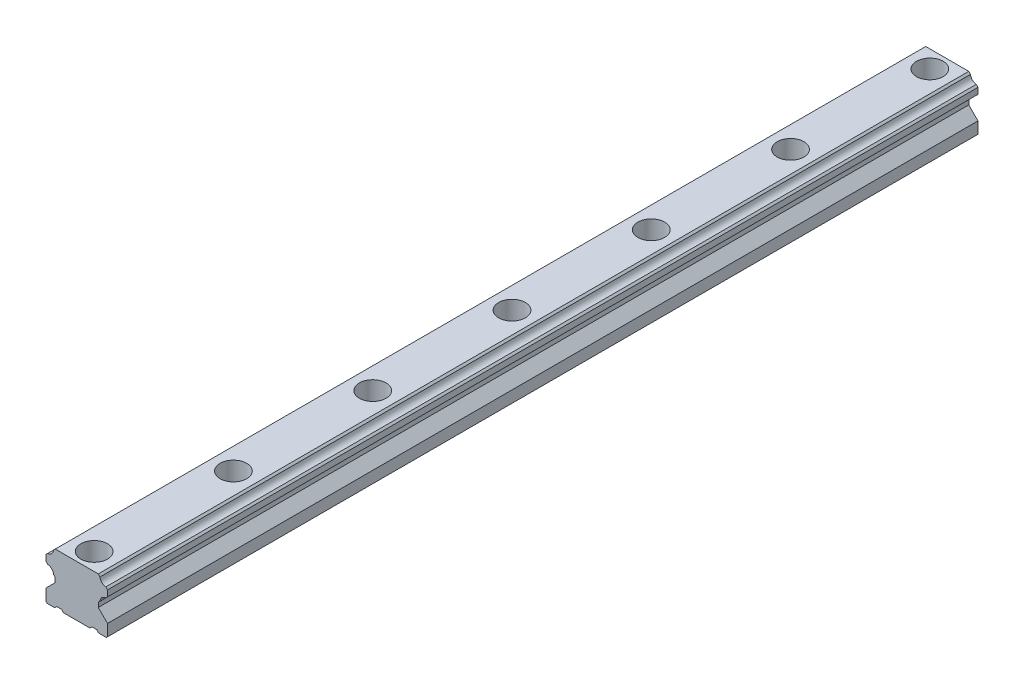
ISO-10303-21;
HEADER;
FILE_DESCRIPTION(('STEP AP214'),'2;1');
FILE_NAME('part.step','',(''),(''),'','','');
FILE_SCHEMA(('AUTOMOTIVE_DESIGN { 1 0 10303 214 1 1 1 1 }'));
ENDSEC;
DATA;
#1=APPLICATION_CONTEXT('core data for automotive mechanical design processes');
#2=APPLICATION_PROTOCOL_DEFINITION('international standard','automotive_design',2000,#1);
#3=PRODUCT_CONTEXT('',#1,'mechanical');
#4=PRODUCT('Part','Part','',(#3));
#5=PRODUCT_RELATED_PRODUCT_CATEGORY('part','',(#4));
#6=PRODUCT_DEFINITION_FORMATION('','',#4);
#7=PRODUCT_DEFINITION_CONTEXT('part definition',#1,'design');
#8=PRODUCT_DEFINITION('design','',#6,#7);
#9=PRODUCT_DEFINITION_SHAPE('','',#8);
#10=(LENGTH_UNIT() NAMED_UNIT(*) SI_UNIT(.MILLI.,.METRE.));
#11=(NAMED_UNIT(*) PLANE_ANGLE_UNIT() SI_UNIT($,.RADIAN.));
#12=(NAMED_UNIT(*) SI_UNIT($,.STERADIAN.) SOLID_ANGLE_UNIT());
#13=UNCERTAINTY_MEASURE_WITH_UNIT(LENGTH_MEASURE(1.E-05),#10,'distance_accuracy_value','');
#14=(GEOMETRIC_REPRESENTATION_CONTEXT(3) GLOBAL_UNCERTAINTY_ASSIGNED_CONTEXT((#13)) GLOBAL_UNIT_ASSIGNED_CONTEXT((#10,
#11,#12)) REPRESENTATION_CONTEXT('',''));
#15=CARTESIAN_POINT('',(0.,0.,0.));
#16=DIRECTION('',(0.,0.,1.));
#17=DIRECTION('',(1.,0.,0.));
#18=AXIS2_PLACEMENT_3D('',#15,#16,#17);
#19=CARTESIAN_POINT('',(-12.9915440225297,-20.2555392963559,750.));
#20=DIRECTION('',(0.707106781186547,0.707106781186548,0.));
#21=DIRECTION('',(-0.707106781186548,0.707106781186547,0.));
#22=AXIS2_PLACEMENT_3D('',#19,#20,#21);
#23=PLANE('',#22);
#24=DIRECTION('',(0.707106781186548,-0.707106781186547,0.));
#25=VECTOR('',#24,1.);
#26=CARTESIAN_POINT('',(-12.9915440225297,-20.2555392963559,0.));
#27=LINE('',#26,#25);
#28=CARTESIAN_POINT('',(-12.9915440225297,-20.2555392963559,0.));
#29=VERTEX_POINT('',#28);
#30=CARTESIAN_POINT('',(-11.2248773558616,-22.022205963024,0.));
#31=VERTEX_POINT('',#30);
#32=EDGE_CURVE('E292',#29,#31,#27,.T.);
#33=ORIENTED_EDGE('',*,*,#32,.T.);
#34=DIRECTION('',(0.,0.,-1.));
#35=VECTOR('',#34,1.);
#36=CARTESIAN_POINT('',(-11.2248773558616,-22.022205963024,750.));
#37=LINE('',#36,#35);
#38=CARTESIAN_POINT('',(-11.2248773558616,-22.022205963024,750.));
#39=VERTEX_POINT('',#38);
#40=EDGE_CURVE('E12',#39,#31,#37,.T.);
#41=ORIENTED_EDGE('',*,*,#40,.F.);
#42=DIRECTION('',(0.707106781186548,-0.707106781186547,0.));
#43=VECTOR('',#42,1.);
#44=CARTESIAN_POINT('',(-12.9915440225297,-20.2555392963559,750.));
#45=LINE('',#44,#43);
#46=CARTESIAN_POINT('',(-12.9915440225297,-20.2555392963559,750.));
#47=VERTEX_POINT('',#46);
#48=EDGE_CURVE('E387',#47,#39,#45,.T.);
#49=ORIENTED_EDGE('',*,*,#48,.F.);
#50=DIRECTION('',(0.,0.,-1.));
#51=VECTOR('',#50,1.);
#52=CARTESIAN_POINT('',(-12.9915440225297,-20.2555392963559,750.));
#53=LINE('',#52,#51);
#54=EDGE_CURVE('E288',#47,#29,#53,.T.);
#55=ORIENTED_EDGE('',*,*,#54,.T.);
#56=EDGE_LOOP('',(#33,#41,#49,#55));
#57=FACE_BOUND('',#56,.T.);
#58=ADVANCED_FACE('F47',(#57),#23,.F.);
#59=CARTESIAN_POINT('',(-11.2248773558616,-22.022205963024,750.));
#60=DIRECTION('',(0.,1.,0.));
#61=DIRECTION('',(0.,0.,1.));
#62=AXIS2_PLACEMENT_3D('',#59,#60,#61);
#63=PLANE('',#62);
#64=CARTESIAN_POINT('',(0.132265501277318,-22.0222059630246,135.));
#65=DIRECTION('',(0.,1.,0.));
#66=DIRECTION('',(0.,0.,1.));
#67=AXIS2_PLACEMENT_3D('',#64,#65,#66);
#68=CIRCLE('',#67,7.99999999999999);
#69=CARTESIAN_POINT('',(0.132265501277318,-22.0222059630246,142.999999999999));
#70=VERTEX_POINT('',#69);
#71=EDGE_CURVE('E1375',#70,#70,#68,.T.);
#72=ORIENTED_EDGE('',*,*,#71,.T.);
#73=EDGE_LOOP('',(#72));
#74=FACE_BOUND('',#73,.T.);
#75=CARTESIAN_POINT('',(0.132265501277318,-22.0222059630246,254.999999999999));
#76=DIRECTION('',(0.,1.,0.));
#77=DIRECTION('',(0.,0.,1.));
#78=AXIS2_PLACEMENT_3D('',#75,#76,#77);
#79=CIRCLE('',#78,7.99999999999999);
#80=CARTESIAN_POINT('',(0.132265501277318,-22.0222059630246,262.999999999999));
#81=VERTEX_POINT('',#80);
#82=EDGE_CURVE('E1390',#81,#81,#79,.T.);
#83=ORIENTED_EDGE('',*,*,#82,.T.);
#84=EDGE_LOOP('',(#83));
#85=FACE_BOUND('',#84,.T.);
#86=CARTESIAN_POINT('',(0.132265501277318,-22.0222059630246,374.999999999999));
#87=DIRECTION('',(0.,1.,0.));
#88=DIRECTION('',(0.,0.,1.));
#89=AXIS2_PLACEMENT_3D('',#86,#87,#88);
#90=CIRCLE('',#89,7.99999999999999);
#91=CARTESIAN_POINT('',(0.132265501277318,-22.0222059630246,382.999999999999));
#92=VERTEX_POINT('',#91);
#93=EDGE_CURVE('E1406',#92,#92,#90,.T.);
#94=ORIENTED_EDGE('',*,*,#93,.T.);
#95=EDGE_LOOP('',(#94));
#96=FACE_BOUND('',#95,.T.);
#97=CARTESIAN_POINT('',(0.132265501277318,-22.0222059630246,494.999999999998));
#98=DIRECTION('',(0.,1.,0.));
#99=DIRECTION('',(0.,0.,1.));
#100=AXIS2_PLACEMENT_3D('',#97,#98,#99);
#101=CIRCLE('',#100,7.99999999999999);
#102=CARTESIAN_POINT('',(0.132265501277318,-22.0222059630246,502.999999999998));
#103=VERTEX_POINT('',#102);
#104=EDGE_CURVE('E1422',#103,#103,#101,.T.);
#105=ORIENTED_EDGE('',*,*,#104,.T.);
#106=EDGE_LOOP('',(#105));
#107=FACE_BOUND('',#106,.T.);
#108=CARTESIAN_POINT('',(0.132265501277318,-22.0222059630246,614.999999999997));
#109=DIRECTION('',(0.,1.,0.));
#110=DIRECTION('',(0.,0.,1.));
#111=AXIS2_PLACEMENT_3D('',#108,#109,#110);
#112=CIRCLE('',#111,7.99999999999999);
#113=CARTESIAN_POINT('',(0.132265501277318,-22.0222059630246,622.999999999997));
#114=VERTEX_POINT('',#113);
#115=EDGE_CURVE('E1438',#114,#114,#112,.T.);
#116=ORIENTED_EDGE('',*,*,#115,.T.);
#117=EDGE_LOOP('',(#116));
#118=FACE_BOUND('',#117,.T.);
#119=CARTESIAN_POINT('',(0.132265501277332,-22.0222059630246,734.999999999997));
#120=DIRECTION('',(0.,1.,0.));
#121=DIRECTION('',(0.,0.,1.));
#122=AXIS2_PLACEMENT_3D('',#119,#120,#121);
#123=CIRCLE('',#122,7.99999999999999);
#124=CARTESIAN_POINT('',(0.132265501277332,-22.0222059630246,742.999999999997));
#125=VERTEX_POINT('',#124);
#126=EDGE_CURVE('E1454',#125,#125,#123,.T.);
#127=ORIENTED_EDGE('',*,*,#126,.T.);
#128=EDGE_LOOP('',(#127));
#129=FACE_BOUND('',#128,.T.);
#130=CARTESIAN_POINT('',(0.132265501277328,-22.0222059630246,15.));
#131=DIRECTION('',(0.,1.,0.));
#132=DIRECTION('',(0.,0.,1.));
#133=AXIS2_PLACEMENT_3D('',#130,#131,#132);
#134=CIRCLE('',#133,7.99999999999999);
#135=CARTESIAN_POINT('',(0.132265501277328,-22.0222059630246,23.));
#136=VERTEX_POINT('',#135);
#137=EDGE_CURVE('E297',#136,#136,#134,.T.);
#138=ORIENTED_EDGE('',*,*,#137,.T.);
#139=EDGE_LOOP('',(#138));
#140=FACE_BOUND('',#139,.T.);
#141=DIRECTION('',(1.,0.,0.));
#142=VECTOR('',#141,1.);
#143=CARTESIAN_POINT('',(-11.2248773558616,-22.022205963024,0.));
#144=LINE('',#143,#142);
#145=CARTESIAN_POINT('',(11.4894083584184,-22.022205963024,0.));
#146=VERTEX_POINT('',#145);
#147=EDGE_CURVE('E296',#31,#146,#144,.T.);
#148=ORIENTED_EDGE('',*,*,#147,.T.);
#149=DIRECTION('',(0.,0.,-1.));
#150=VECTOR('',#149,1.);
#151=CARTESIAN_POINT('',(11.4894083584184,-22.022205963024,750.));
#152=LINE('',#151,#150);
#153=CARTESIAN_POINT('',(11.4894083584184,-22.022205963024,750.));
#154=VERTEX_POINT('',#153);
#155=EDGE_CURVE('E56',#154,#146,#152,.T.);
#156=ORIENTED_EDGE('',*,*,#155,.F.);
#157=DIRECTION('',(1.,0.,0.));
#158=VECTOR('',#157,1.);
#159=CARTESIAN_POINT('',(-11.2248773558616,-22.022205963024,750.));
#160=LINE('',#159,#158);
#161=EDGE_CURVE('E179',#39,#154,#160,.T.);
#162=ORIENTED_EDGE('',*,*,#161,.F.);
#163=ORIENTED_EDGE('',*,*,#40,.T.);
#164=EDGE_LOOP('',(#148,#156,#162,#163));
#165=FACE_BOUND('',#164,.T.);
#166=ADVANCED_FACE('F621',(#74,#85,#96,#107,#118,#129,#140,#165),#63,.F.);
#167=CARTESIAN_POINT('',(11.4894083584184,-22.022205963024,750.));
#168=DIRECTION('',(-0.707106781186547,0.707106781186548,0.));
#169=DIRECTION('',(-0.707106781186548,-0.707106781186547,0.));
#170=AXIS2_PLACEMENT_3D('',#167,#168,#169);
#171=PLANE('',#170);
#172=DIRECTION('',(0.707106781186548,0.707106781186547,0.));
#173=VECTOR('',#172,1.);
#174=CARTESIAN_POINT('',(11.4894083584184,-22.022205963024,0.));
#175=LINE('',#174,#173);
#176=CARTESIAN_POINT('',(13.2560750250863,-20.2555392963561,0.));
#177=VERTEX_POINT('',#176);
#178=EDGE_CURVE('E300',#146,#177,#175,.T.);
#179=ORIENTED_EDGE('',*,*,#178,.T.);
#180=DIRECTION('',(0.,0.,-1.));
#181=VECTOR('',#180,1.);
#182=CARTESIAN_POINT('',(13.2560750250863,-20.2555392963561,750.));
#183=LINE('',#182,#181);
#184=CARTESIAN_POINT('',(13.2560750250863,-20.2555392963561,750.));
#185=VERTEX_POINT('',#184);
#186=EDGE_CURVE('E494',#185,#177,#183,.T.);
#187=ORIENTED_EDGE('',*,*,#186,.F.);
#188=DIRECTION('',(0.707106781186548,0.707106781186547,0.));
#189=VECTOR('',#188,1.);
#190=CARTESIAN_POINT('',(11.4894083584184,-22.022205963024,750.));
#191=LINE('',#190,#189);
#192=EDGE_CURVE('E504',#154,#185,#191,.T.);
#193=ORIENTED_EDGE('',*,*,#192,.F.);
#194=ORIENTED_EDGE('',*,*,#155,.T.);
#195=EDGE_LOOP('',(#179,#187,#193,#194));
#196=FACE_BOUND('',#195,.T.);
#197=ADVANCED_FACE('F502',(#196),#171,.F.);
#198=CARTESIAN_POINT('',(13.2560750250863,-20.2555392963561,750.));
#199=DIRECTION('',(0.,1.,0.));
#200=DIRECTION('',(0.,0.,1.));
#201=AXIS2_PLACEMENT_3D('',#198,#199,#200);
#202=PLANE('',#201);
#203=DIRECTION('',(1.,0.,0.));
#204=VECTOR('',#203,1.);
#205=CARTESIAN_POINT('',(13.2560750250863,-20.2555392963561,0.));
#206=LINE('',#205,#204);
#207=CARTESIAN_POINT('',(17.2941702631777,-20.2555392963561,0.));
#208=VERTEX_POINT('',#207);
#209=EDGE_CURVE('E303',#177,#208,#206,.T.);
#210=ORIENTED_EDGE('',*,*,#209,.T.);
#211=DIRECTION('',(0.,0.,-1.));
#212=VECTOR('',#211,1.);
#213=CARTESIAN_POINT('',(17.2941702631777,-20.2555392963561,750.));
#214=LINE('',#213,#212);
#215=CARTESIAN_POINT('',(17.2941702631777,-20.2555392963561,750.));
#216=VERTEX_POINT('',#215);
#217=EDGE_CURVE('E490',#216,#208,#214,.T.);
#218=ORIENTED_EDGE('',*,*,#217,.F.);
#219=DIRECTION('',(1.,0.,0.));
#220=VECTOR('',#219,1.);
#221=CARTESIAN_POINT('',(13.2560750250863,-20.2555392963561,750.));
#222=LINE('',#221,#220);
#223=EDGE_CURVE('E523',#185,#216,#222,.T.);
#224=ORIENTED_EDGE('',*,*,#223,.F.);
#225=ORIENTED_EDGE('',*,*,#186,.T.);
#226=EDGE_LOOP('',(#210,#218,#224,#225));
#227=FACE_BOUND('',#226,.T.);
#228=ADVANCED_FACE('F513',(#227),#202,.F.);
#229=CARTESIAN_POINT('',(17.2941702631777,-20.2555392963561,750.));
#230=DIRECTION('',(0.707106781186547,0.707106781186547,0.));
#231=DIRECTION('',(-0.707106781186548,0.707106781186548,0.));
#232=AXIS2_PLACEMENT_3D('',#229,#230,#231);
#233=PLANE('',#232);
#234=DIRECTION('',(0.707106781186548,-0.707106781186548,0.));
#235=VECTOR('',#234,1.);
#236=CARTESIAN_POINT('',(17.2941702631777,-20.2555392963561,0.));
#237=LINE('',#236,#235);
#238=CARTESIAN_POINT('',(19.0608369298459,-22.0222059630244,0.));
#239=VERTEX_POINT('',#238);
#240=EDGE_CURVE('E306',#208,#239,#237,.T.);
#241=ORIENTED_EDGE('',*,*,#240,.T.);
#242=DIRECTION('',(0.,0.,-1.));
#243=VECTOR('',#242,1.);
#244=CARTESIAN_POINT('',(19.0608369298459,-22.0222059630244,750.));
#245=LINE('',#244,#243);
#246=CARTESIAN_POINT('',(19.0608369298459,-22.0222059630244,750.));
#247=VERTEX_POINT('',#246);
#248=EDGE_CURVE('E486',#247,#239,#245,.T.);
#249=ORIENTED_EDGE('',*,*,#248,.F.);
#250=DIRECTION('',(0.707106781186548,-0.707106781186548,0.));
#251=VECTOR('',#250,1.);
#252=CARTESIAN_POINT('',(17.2941702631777,-20.2555392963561,750.));
#253=LINE('',#252,#251);
#254=EDGE_CURVE('E519',#216,#247,#253,.T.);
#255=ORIENTED_EDGE('',*,*,#254,.F.);
#256=ORIENTED_EDGE('',*,*,#217,.T.);
#257=EDGE_LOOP('',(#241,#249,#255,#256));
#258=FACE_BOUND('',#257,.T.);
#259=ADVANCED_FACE('F517',(#258),#233,.F.);
#260=CARTESIAN_POINT('',(19.0608369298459,-22.0222059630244,750.));
#261=DIRECTION('',(0.,1.,0.));
#262=DIRECTION('',(0.,0.,1.));
#263=AXIS2_PLACEMENT_3D('',#260,#261,#262);
#264=PLANE('',#263);
#265=DIRECTION('',(1.,0.,0.));
#266=VECTOR('',#265,1.);
#267=CARTESIAN_POINT('',(19.0608369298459,-22.0222059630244,0.));
#268=LINE('',#267,#266);
#269=CARTESIAN_POINT('',(25.6322655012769,-22.0222059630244,0.));
#270=VERTEX_POINT('',#269);
#271=EDGE_CURVE('E309',#239,#270,#268,.T.);
#272=ORIENTED_EDGE('',*,*,#271,.T.);
#273=DIRECTION('',(0.,0.,-1.));
#274=VECTOR('',#273,1.);
#275=CARTESIAN_POINT('',(25.6322655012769,-22.0222059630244,750.));
#276=LINE('',#275,#274);
#277=CARTESIAN_POINT('',(25.6322655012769,-22.0222059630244,750.));
#278=VERTEX_POINT('',#277);
#279=EDGE_CURVE('E482',#278,#270,#276,.T.);
#280=ORIENTED_EDGE('',*,*,#279,.F.);
#281=DIRECTION('',(1.,0.,0.));
#282=VECTOR('',#281,1.);
#283=CARTESIAN_POINT('',(19.0608369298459,-22.0222059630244,750.));
#284=LINE('',#283,#282);
#285=EDGE_CURVE('E522',#247,#278,#284,.T.);
#286=ORIENTED_EDGE('',*,*,#285,.F.);
#287=ORIENTED_EDGE('',*,*,#248,.T.);
#288=EDGE_LOOP('',(#272,#280,#286,#287));
#289=FACE_BOUND('',#288,.T.);
#290=ADVANCED_FACE('F637',(#289),#264,.F.);
#291=CARTESIAN_POINT('',(25.6322655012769,-22.0222059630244,750.));
#292=DIRECTION('',(-0.707106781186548,0.707106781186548,0.));
#293=DIRECTION('',(-0.707106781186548,-0.707106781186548,0.));
#294=AXIS2_PLACEMENT_3D('',#291,#292,#293);
#295=PLANE('',#294);
#296=DIRECTION('',(0.707106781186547,0.707106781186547,0.));
#297=VECTOR('',#296,1.);
#298=CARTESIAN_POINT('',(25.6322655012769,-22.0222059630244,0.));
#299=LINE('',#298,#297);
#300=CARTESIAN_POINT('',(26.6322655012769,-21.0222059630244,0.));
#301=VERTEX_POINT('',#300);
#302=EDGE_CURVE('E312',#270,#301,#299,.T.);
#303=ORIENTED_EDGE('',*,*,#302,.T.);
#304=DIRECTION('',(0.,0.,-1.));
#305=VECTOR('',#304,1.);
#306=CARTESIAN_POINT('',(26.6322655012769,-21.0222059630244,750.));
#307=LINE('',#306,#305);
#308=CARTESIAN_POINT('',(26.6322655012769,-21.0222059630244,750.));
#309=VERTEX_POINT('',#308);
#310=EDGE_CURVE('E478',#309,#301,#307,.T.);
#311=ORIENTED_EDGE('',*,*,#310,.F.);
#312=DIRECTION('',(0.707106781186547,0.707106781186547,0.));
#313=VECTOR('',#312,1.);
#314=CARTESIAN_POINT('',(25.6322655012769,-22.0222059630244,750.));
#315=LINE('',#314,#313);
#316=EDGE_CURVE('E527',#278,#309,#315,.T.);
#317=ORIENTED_EDGE('',*,*,#316,.F.);
#318=ORIENTED_EDGE('',*,*,#279,.T.);
#319=EDGE_LOOP('',(#303,#311,#317,#318));
#320=FACE_BOUND('',#319,.T.);
#321=ADVANCED_FACE('F640',(#320),#295,.F.);
#322=CARTESIAN_POINT('',(26.6322655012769,-21.0222059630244,750.));
#323=DIRECTION('',(-1.,0.,0.));
#324=DIRECTION('',(0.,0.,1.));
#325=AXIS2_PLACEMENT_3D('',#322,#323,#324);
#326=PLANE('',#325);
#327=DIRECTION('',(0.,1.,0.));
#328=VECTOR('',#327,1.);
#329=CARTESIAN_POINT('',(26.6322655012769,-21.0222059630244,0.));
#330=LINE('',#329,#328);
#331=CARTESIAN_POINT('',(26.6322655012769,-11.0222059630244,0.));
#332=VERTEX_POINT('',#331);
#333=EDGE_CURVE('E315',#301,#332,#330,.T.);
#334=ORIENTED_EDGE('',*,*,#333,.T.);
#335=DIRECTION('',(0.,0.,-1.));
#336=VECTOR('',#335,1.);
#337=CARTESIAN_POINT('',(26.6322655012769,-11.0222059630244,750.));
#338=LINE('',#337,#336);
#339=CARTESIAN_POINT('',(26.6322655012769,-11.0222059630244,750.));
#340=VERTEX_POINT('',#339);
#341=EDGE_CURVE('E474',#340,#332,#338,.T.);
#342=ORIENTED_EDGE('',*,*,#341,.F.);
#343=DIRECTION('',(0.,1.,0.));
#344=VECTOR('',#343,1.);
#345=CARTESIAN_POINT('',(26.6322655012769,-21.0222059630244,750.));
#346=LINE('',#345,#344);
#347=EDGE_CURVE('E534',#309,#340,#346,.T.);
#348=ORIENTED_EDGE('',*,*,#347,.F.);
#349=ORIENTED_EDGE('',*,*,#310,.T.);
#350=EDGE_LOOP('',(#334,#342,#348,#349));
#351=FACE_BOUND('',#350,.T.);
#352=ADVANCED_FACE('F644',(#351),#326,.F.);
#353=CARTESIAN_POINT('',(26.6322655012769,-11.0222059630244,750.));
#354=DIRECTION('',(-0.707106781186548,-0.707106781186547,0.));
#355=DIRECTION('',(0.707106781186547,-0.707106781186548,0.));
#356=AXIS2_PLACEMENT_3D('',#353,#354,#355);
#357=PLANE('',#356);
#358=DIRECTION('',(-0.707106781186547,0.707106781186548,0.));
#359=VECTOR('',#358,1.);
#360=CARTESIAN_POINT('',(26.6322655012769,-11.0222059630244,0.));
#361=LINE('',#360,#359);
#362=CARTESIAN_POINT('',(18.6822655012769,-3.07220596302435,0.));
#363=VERTEX_POINT('',#362);
#364=EDGE_CURVE('E318',#332,#363,#361,.T.);
#365=ORIENTED_EDGE('',*,*,#364,.T.);
#366=DIRECTION('',(0.,0.,-1.));
#367=VECTOR('',#366,1.);
#368=CARTESIAN_POINT('',(18.6822655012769,-3.07220596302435,750.));
#369=LINE('',#368,#367);
#370=CARTESIAN_POINT('',(18.6822655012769,-3.07220596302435,750.));
#371=VERTEX_POINT('',#370);
#372=EDGE_CURVE('E470',#371,#363,#369,.T.);
#373=ORIENTED_EDGE('',*,*,#372,.F.);
#374=DIRECTION('',(-0.707106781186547,0.707106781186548,0.));
#375=VECTOR('',#374,1.);
#376=CARTESIAN_POINT('',(26.6322655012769,-11.0222059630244,750.));
#377=LINE('',#376,#375);
#378=EDGE_CURVE('E537',#340,#371,#377,.T.);
#379=ORIENTED_EDGE('',*,*,#378,.F.);
#380=ORIENTED_EDGE('',*,*,#341,.T.);
#381=EDGE_LOOP('',(#365,#373,#379,#380));
#382=FACE_BOUND('',#381,.T.);
#383=ADVANCED_FACE('F648',(#382),#357,.F.);
#384=CARTESIAN_POINT('',(18.6822655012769,-3.07220596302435,750.));
#385=DIRECTION('',(-1.,0.,0.));
#386=DIRECTION('',(0.,0.,1.));
#387=AXIS2_PLACEMENT_3D('',#384,#385,#386);
#388=PLANE('',#387);
#389=DIRECTION('',(0.,1.,0.));
#390=VECTOR('',#389,1.);
#391=CARTESIAN_POINT('',(18.6822655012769,-3.07220596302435,0.));
#392=LINE('',#391,#390);
#393=CARTESIAN_POINT('',(18.6822655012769,0.827794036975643,0.));
#394=VERTEX_POINT('',#393);
#395=EDGE_CURVE('E321',#363,#394,#392,.T.);
#396=ORIENTED_EDGE('',*,*,#395,.T.);
#397=DIRECTION('',(0.,0.,-1.));
#398=VECTOR('',#397,1.);
#399=CARTESIAN_POINT('',(18.6822655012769,0.827794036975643,750.));
#400=LINE('',#399,#398);
#401=CARTESIAN_POINT('',(18.6822655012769,0.827794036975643,750.));
#402=VERTEX_POINT('',#401);
#403=EDGE_CURVE('E466',#402,#394,#400,.T.);
#404=ORIENTED_EDGE('',*,*,#403,.F.);
#405=DIRECTION('',(0.,1.,0.));
#406=VECTOR('',#405,1.);
#407=CARTESIAN_POINT('',(18.6822655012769,-3.07220596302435,750.));
#408=LINE('',#407,#406);
#409=EDGE_CURVE('E540',#371,#402,#408,.T.);
#410=ORIENTED_EDGE('',*,*,#409,.F.);
#411=ORIENTED_EDGE('',*,*,#372,.T.);
#412=EDGE_LOOP('',(#396,#404,#410,#411));
#413=FACE_BOUND('',#412,.T.);
#414=ADVANCED_FACE('F652',(#413),#388,.F.);
#415=CARTESIAN_POINT('',(18.6822655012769,0.827794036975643,750.));
#416=DIRECTION('',(-0.707106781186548,0.707106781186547,0.));
#417=DIRECTION('',(-0.707106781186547,-0.707106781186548,0.));
#418=AXIS2_PLACEMENT_3D('',#415,#416,#417);
#419=PLANE('',#418);
#420=DIRECTION('',(0.707106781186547,0.707106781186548,0.));
#421=VECTOR('',#420,1.);
#422=CARTESIAN_POINT('',(18.6822655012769,0.827794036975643,0.));
#423=LINE('',#422,#421);
#424=CARTESIAN_POINT('',(20.1784174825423,2.32394601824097,0.));
#425=VERTEX_POINT('',#424);
#426=EDGE_CURVE('E324',#394,#425,#423,.T.);
#427=ORIENTED_EDGE('',*,*,#426,.T.);
#428=DIRECTION('',(0.,0.,-1.));
#429=VECTOR('',#428,1.);
#430=CARTESIAN_POINT('',(20.1784174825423,2.32394601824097,750.));
#431=LINE('',#430,#429);
#432=CARTESIAN_POINT('',(20.1784174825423,2.32394601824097,750.));
#433=VERTEX_POINT('',#432);
#434=EDGE_CURVE('E462',#433,#425,#431,.T.);
#435=ORIENTED_EDGE('',*,*,#434,.F.);
#436=DIRECTION('',(0.707106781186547,0.707106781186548,0.));
#437=VECTOR('',#436,1.);
#438=CARTESIAN_POINT('',(18.6822655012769,0.827794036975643,750.));
#439=LINE('',#438,#437);
#440=EDGE_CURVE('E543',#402,#433,#439,.T.);
#441=ORIENTED_EDGE('',*,*,#440,.F.);
#442=ORIENTED_EDGE('',*,*,#403,.T.);
#443=EDGE_LOOP('',(#427,#435,#441,#442));
#444=FACE_BOUND('',#443,.T.);
#445=ADVANCED_FACE('F656',(#444),#419,.F.);
#446=CARTESIAN_POINT('',(25.4680149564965,1.99204458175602,750.));
#447=DIRECTION('',(0.,0.,-1.));
#448=DIRECTION('',(-1.,0.,0.));
#449=AXIS2_PLACEMENT_3D('',#446,#447,#448);
#450=CYLINDRICAL_SURFACE('',#449,5.30000000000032);
#451=CARTESIAN_POINT('',(25.4680149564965,1.99204458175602,0.));
#452=DIRECTION('',(0.,0.,-1.));
#453=DIRECTION('',(1.,0.,0.));
#454=AXIS2_PLACEMENT_3D('',#451,#452,#453);
#455=CIRCLE('',#454,5.30000000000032);
#456=CARTESIAN_POINT('',(25.1361135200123,7.28164205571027,0.));
#457=VERTEX_POINT('',#456);
#458=EDGE_CURVE('E327',#425,#457,#455,.T.);
#459=ORIENTED_EDGE('',*,*,#458,.T.);
#460=DIRECTION('',(0.,0.,-1.));
#461=VECTOR('',#460,1.);
#462=CARTESIAN_POINT('',(25.1361135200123,7.28164205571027,750.));
#463=LINE('',#462,#461);
#464=CARTESIAN_POINT('',(25.1361135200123,7.28164205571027,750.));
#465=VERTEX_POINT('',#464);
#466=EDGE_CURVE('E458',#465,#457,#463,.T.);
#467=ORIENTED_EDGE('',*,*,#466,.F.);
#468=CARTESIAN_POINT('',(25.4680149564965,1.99204458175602,750.));
#469=DIRECTION('',(0.,0.,-1.));
#470=DIRECTION('',(1.,0.,0.));
#471=AXIS2_PLACEMENT_3D('',#468,#469,#470);
#472=CIRCLE('',#471,5.30000000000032);
#473=EDGE_CURVE('E546',#433,#465,#472,.T.);
#474=ORIENTED_EDGE('',*,*,#473,.F.);
#475=ORIENTED_EDGE('',*,*,#434,.T.);
#476=EDGE_LOOP('',(#459,#467,#474,#475));
#477=FACE_BOUND('',#476,.T.);
#478=ADVANCED_FACE('F660',(#477),#450,.F.);
#479=CARTESIAN_POINT('',(25.1361135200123,7.28164205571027,750.));
#480=DIRECTION('',(-0.707106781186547,0.707106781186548,0.));
#481=DIRECTION('',(-0.707106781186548,-0.707106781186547,0.));
#482=AXIS2_PLACEMENT_3D('',#479,#480,#481);
#483=PLANE('',#482);
#484=DIRECTION('',(0.707106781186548,0.707106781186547,0.));
#485=VECTOR('',#484,1.);
#486=CARTESIAN_POINT('',(25.1361135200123,7.28164205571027,0.));
#487=LINE('',#486,#485);
#488=CARTESIAN_POINT('',(26.6322655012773,8.77779403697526,0.));
#489=VERTEX_POINT('',#488);
#490=EDGE_CURVE('E330',#457,#489,#487,.T.);
#491=ORIENTED_EDGE('',*,*,#490,.T.);
#492=DIRECTION('',(0.,0.,-1.));
#493=VECTOR('',#492,1.);
#494=CARTESIAN_POINT('',(26.6322655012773,8.77779403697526,750.));
#495=LINE('',#494,#493);
#496=CARTESIAN_POINT('',(26.6322655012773,8.77779403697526,750.));
#497=VERTEX_POINT('',#496);
#498=EDGE_CURVE('E454',#497,#489,#495,.T.);
#499=ORIENTED_EDGE('',*,*,#498,.F.);
#500=DIRECTION('',(0.707106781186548,0.707106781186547,0.));
#501=VECTOR('',#500,1.);
#502=CARTESIAN_POINT('',(25.1361135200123,7.28164205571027,750.));
#503=LINE('',#502,#501);
#504=EDGE_CURVE('E549',#465,#497,#503,.T.);
#505=ORIENTED_EDGE('',*,*,#504,.F.);
#506=ORIENTED_EDGE('',*,*,#466,.T.);
#507=EDGE_LOOP('',(#491,#499,#505,#506));
#508=FACE_BOUND('',#507,.T.);
#509=ADVANCED_FACE('F664',(#508),#483,.F.);
#510=CARTESIAN_POINT('',(26.6322655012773,8.77779403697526,750.));
#511=DIRECTION('',(-1.,0.,0.));
#512=DIRECTION('',(0.,0.,1.));
#513=AXIS2_PLACEMENT_3D('',#510,#511,#512);
#514=PLANE('',#513);
#515=DIRECTION('',(0.,1.,0.));
#516=VECTOR('',#515,1.);
#517=CARTESIAN_POINT('',(26.6322655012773,8.77779403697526,0.));
#518=LINE('',#517,#516);
#519=CARTESIAN_POINT('',(26.6322655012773,14.0277940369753,0.));
#520=VERTEX_POINT('',#519);
#521=EDGE_CURVE('E333',#489,#520,#518,.T.);
#522=ORIENTED_EDGE('',*,*,#521,.T.);
#523=DIRECTION('',(0.,0.,-1.));
#524=VECTOR('',#523,1.);
#525=CARTESIAN_POINT('',(26.6322655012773,14.0277940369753,750.));
#526=LINE('',#525,#524);
#527=CARTESIAN_POINT('',(26.6322655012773,14.0277940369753,750.));
#528=VERTEX_POINT('',#527);
#529=EDGE_CURVE('E450',#528,#520,#526,.T.);
#530=ORIENTED_EDGE('',*,*,#529,.F.);
#531=DIRECTION('',(0.,1.,0.));
#532=VECTOR('',#531,1.);
#533=CARTESIAN_POINT('',(26.6322655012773,8.77779403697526,750.));
#534=LINE('',#533,#532);
#535=EDGE_CURVE('E552',#497,#528,#534,.T.);
#536=ORIENTED_EDGE('',*,*,#535,.F.);
#537=ORIENTED_EDGE('',*,*,#498,.T.);
#538=EDGE_LOOP('',(#522,#530,#536,#537));
#539=FACE_BOUND('',#538,.T.);
#540=ADVANCED_FACE('F668',(#539),#514,.F.);
#541=CARTESIAN_POINT('',(26.6322655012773,14.0277940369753,750.));
#542=DIRECTION('',(-0.707106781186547,-0.707106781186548,0.));
#543=DIRECTION('',(0.707106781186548,-0.707106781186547,0.));
#544=AXIS2_PLACEMENT_3D('',#541,#542,#543);
#545=PLANE('',#544);
#546=DIRECTION('',(-0.707106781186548,0.707106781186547,0.));
#547=VECTOR('',#546,1.);
#548=CARTESIAN_POINT('',(26.6322655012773,14.0277940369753,0.));
#549=LINE('',#548,#547);
#550=CARTESIAN_POINT('',(25.136113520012,15.5239460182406,0.));
#551=VERTEX_POINT('',#550);
#552=EDGE_CURVE('E336',#520,#551,#549,.T.);
#553=ORIENTED_EDGE('',*,*,#552,.T.);
#554=DIRECTION('',(0.,0.,-1.));
#555=VECTOR('',#554,1.);
#556=CARTESIAN_POINT('',(25.136113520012,15.5239460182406,750.));
#557=LINE('',#556,#555);
#558=CARTESIAN_POINT('',(25.136113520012,15.5239460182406,750.));
#559=VERTEX_POINT('',#558);
#560=EDGE_CURVE('E446',#559,#551,#557,.T.);
#561=ORIENTED_EDGE('',*,*,#560,.F.);
#562=DIRECTION('',(-0.707106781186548,0.707106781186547,0.));
#563=VECTOR('',#562,1.);
#564=CARTESIAN_POINT('',(26.6322655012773,14.0277940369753,750.));
#565=LINE('',#564,#563);
#566=EDGE_CURVE('E555',#528,#559,#565,.T.);
#567=ORIENTED_EDGE('',*,*,#566,.F.);
#568=ORIENTED_EDGE('',*,*,#529,.T.);
#569=EDGE_LOOP('',(#553,#561,#567,#568));
#570=FACE_BOUND('',#569,.T.);
#571=ADVANCED_FACE('F672',(#570),#545,.F.);
#572=CARTESIAN_POINT('',(25.4680149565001,20.8135434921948,750.));
#573=DIRECTION('',(0.,0.,-1.));
#574=DIRECTION('',(-1.,0.,0.));
#575=AXIS2_PLACEMENT_3D('',#572,#573,#574);
#576=CYLINDRICAL_SURFACE('',#575,5.30000000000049);
#577=CARTESIAN_POINT('',(25.4680149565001,20.8135434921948,0.));
#578=DIRECTION('',(0.,0.,-1.));
#579=DIRECTION('',(1.,0.,0.));
#580=AXIS2_PLACEMENT_3D('',#577,#578,#579);
#581=CIRCLE('',#580,5.30000000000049);
#582=CARTESIAN_POINT('',(20.1784174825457,20.4816420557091,0.));
#583=VERTEX_POINT('',#582);
#584=EDGE_CURVE('E339',#551,#583,#581,.T.);
#585=ORIENTED_EDGE('',*,*,#584,.T.);
#586=DIRECTION('',(0.,0.,-1.));
#587=VECTOR('',#586,1.);
#588=CARTESIAN_POINT('',(20.1784174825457,20.4816420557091,750.));
#589=LINE('',#588,#587);
#590=CARTESIAN_POINT('',(20.1784174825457,20.4816420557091,750.));
#591=VERTEX_POINT('',#590);
#592=EDGE_CURVE('E442',#591,#583,#589,.T.);
#593=ORIENTED_EDGE('',*,*,#592,.F.);
#594=CARTESIAN_POINT('',(25.4680149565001,20.8135434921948,750.));
#595=DIRECTION('',(0.,0.,-1.));
#596=DIRECTION('',(1.,0.,0.));
#597=AXIS2_PLACEMENT_3D('',#594,#595,#596);
#598=CIRCLE('',#597,5.30000000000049);
#599=EDGE_CURVE('E558',#559,#591,#598,.T.);
#600=ORIENTED_EDGE('',*,*,#599,.F.);
#601=ORIENTED_EDGE('',*,*,#560,.T.);
#602=EDGE_LOOP('',(#585,#593,#600,#601));
#603=FACE_BOUND('',#602,.T.);
#604=ADVANCED_FACE('F676',(#603),#576,.F.);
#605=CARTESIAN_POINT('',(20.1784174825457,20.4816420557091,750.));
#606=DIRECTION('',(-0.707106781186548,-0.707106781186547,0.));
#607=DIRECTION('',(0.707106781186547,-0.707106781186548,0.));
#608=AXIS2_PLACEMENT_3D('',#605,#606,#607);
#609=PLANE('',#608);
#610=DIRECTION('',(-0.707106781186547,0.707106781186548,0.));
#611=VECTOR('',#610,1.);
#612=CARTESIAN_POINT('',(20.1784174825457,20.4816420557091,0.));
#613=LINE('',#612,#611);
#614=CARTESIAN_POINT('',(18.6822655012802,21.9777940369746,0.));
#615=VERTEX_POINT('',#614);
#616=EDGE_CURVE('E342',#583,#615,#613,.T.);
#617=ORIENTED_EDGE('',*,*,#616,.T.);
#618=DIRECTION('',(0.,0.,-1.));
#619=VECTOR('',#618,1.);
#620=CARTESIAN_POINT('',(18.6822655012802,21.9777940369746,750.));
#621=LINE('',#620,#619);
#622=CARTESIAN_POINT('',(18.6822655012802,21.9777940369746,750.));
#623=VERTEX_POINT('',#622);
#624=EDGE_CURVE('E438',#623,#615,#621,.T.);
#625=ORIENTED_EDGE('',*,*,#624,.F.);
#626=DIRECTION('',(-0.707106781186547,0.707106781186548,0.));
#627=VECTOR('',#626,1.);
#628=CARTESIAN_POINT('',(20.1784174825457,20.4816420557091,750.));
#629=LINE('',#628,#627);
#630=EDGE_CURVE('E561',#591,#623,#629,.T.);
#631=ORIENTED_EDGE('',*,*,#630,.F.);
#632=ORIENTED_EDGE('',*,*,#592,.T.);
#633=EDGE_LOOP('',(#617,#625,#631,#632));
#634=FACE_BOUND('',#633,.T.);
#635=ADVANCED_FACE('F680',(#634),#609,.F.);
#636=CARTESIAN_POINT('',(18.6822655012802,21.9777940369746,750.));
#637=DIRECTION('',(0.,-1.,0.));
#638=DIRECTION('',(0.,0.,-1.));
#639=AXIS2_PLACEMENT_3D('',#636,#637,#638);
#640=PLANE('',#639);
#641=CARTESIAN_POINT('',(0.132265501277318,21.9777940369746,135.));
#642=DIRECTION('',(0.,1.,0.));
#643=DIRECTION('',(0.,0.,1.));
#644=AXIS2_PLACEMENT_3D('',#641,#642,#643);
#645=CIRCLE('',#644,11.5);
#646=CARTESIAN_POINT('',(0.132265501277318,21.9777940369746,146.5));
#647=VERTEX_POINT('',#646);
#648=EDGE_CURVE('E1365',#647,#647,#645,.T.);
#649=ORIENTED_EDGE('',*,*,#648,.F.);
#650=EDGE_LOOP('',(#649));
#651=FACE_BOUND('',#650,.T.);
#652=CARTESIAN_POINT('',(0.132265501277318,21.9777940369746,254.999999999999));
#653=DIRECTION('',(0.,1.,0.));
#654=DIRECTION('',(0.,0.,1.));
#655=AXIS2_PLACEMENT_3D('',#652,#653,#654);
#656=CIRCLE('',#655,11.5);
#657=CARTESIAN_POINT('',(0.132265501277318,21.9777940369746,266.499999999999));
#658=VERTEX_POINT('',#657);
#659=EDGE_CURVE('E1378',#658,#658,#656,.T.);
#660=ORIENTED_EDGE('',*,*,#659,.F.);
#661=EDGE_LOOP('',(#660));
#662=FACE_BOUND('',#661,.T.);
#663=CARTESIAN_POINT('',(0.132265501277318,21.9777940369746,374.999999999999));
#664=DIRECTION('',(0.,1.,0.));
#665=DIRECTION('',(0.,0.,1.));
#666=AXIS2_PLACEMENT_3D('',#663,#664,#665);
#667=CIRCLE('',#666,11.5);
#668=CARTESIAN_POINT('',(0.132265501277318,21.9777940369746,386.499999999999));
#669=VERTEX_POINT('',#668);
#670=EDGE_CURVE('E1394',#669,#669,#667,.T.);
#671=ORIENTED_EDGE('',*,*,#670,.F.);
#672=EDGE_LOOP('',(#671));
#673=FACE_BOUND('',#672,.T.);
#674=CARTESIAN_POINT('',(0.132265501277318,21.9777940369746,494.999999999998));
#675=DIRECTION('',(0.,1.,0.));
#676=DIRECTION('',(0.,0.,1.));
#677=AXIS2_PLACEMENT_3D('',#674,#675,#676);
#678=CIRCLE('',#677,11.5);
#679=CARTESIAN_POINT('',(0.132265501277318,21.9777940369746,506.499999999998));
#680=VERTEX_POINT('',#679);
#681=EDGE_CURVE('E1410',#680,#680,#678,.T.);
#682=ORIENTED_EDGE('',*,*,#681,.F.);
#683=EDGE_LOOP('',(#682));
#684=FACE_BOUND('',#683,.T.);
#685=CARTESIAN_POINT('',(0.132265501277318,21.9777940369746,614.999999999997));
#686=DIRECTION('',(0.,1.,0.));
#687=DIRECTION('',(0.,0.,1.));
#688=AXIS2_PLACEMENT_3D('',#685,#686,#687);
#689=CIRCLE('',#688,11.5);
#690=CARTESIAN_POINT('',(0.132265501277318,21.9777940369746,626.499999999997));
#691=VERTEX_POINT('',#690);
#692=EDGE_CURVE('E1426',#691,#691,#689,.T.);
#693=ORIENTED_EDGE('',*,*,#692,.F.);
#694=EDGE_LOOP('',(#693));
#695=FACE_BOUND('',#694,.T.);
#696=CARTESIAN_POINT('',(0.132265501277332,21.9777940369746,734.999999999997));
#697=DIRECTION('',(0.,1.,0.));
#698=DIRECTION('',(0.,0.,1.));
#699=AXIS2_PLACEMENT_3D('',#696,#697,#698);
#700=CIRCLE('',#699,11.5);
#701=CARTESIAN_POINT('',(0.132265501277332,21.9777940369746,746.499999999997));
#702=VERTEX_POINT('',#701);
#703=EDGE_CURVE('E1442',#702,#702,#700,.T.);
#704=ORIENTED_EDGE('',*,*,#703,.F.);
#705=EDGE_LOOP('',(#704));
#706=FACE_BOUND('',#705,.T.);
#707=CARTESIAN_POINT('',(0.132265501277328,21.9777940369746,15.));
#708=DIRECTION('',(0.,1.,0.));
#709=DIRECTION('',(0.,0.,1.));
#710=AXIS2_PLACEMENT_3D('',#707,#708,#709);
#711=CIRCLE('',#710,11.5);
#712=CARTESIAN_POINT('',(0.132265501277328,21.9777940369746,26.5));
#713=VERTEX_POINT('',#712);
#714=EDGE_CURVE('E1458',#713,#713,#711,.T.);
#715=ORIENTED_EDGE('',*,*,#714,.F.);
#716=EDGE_LOOP('',(#715));
#717=FACE_BOUND('',#716,.T.);
#718=DIRECTION('',(-1.,0.,0.));
#719=VECTOR('',#718,1.);
#720=CARTESIAN_POINT('',(18.6822655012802,21.9777940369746,0.));
#721=LINE('',#720,#719);
#722=CARTESIAN_POINT('',(-18.4177344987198,21.9777940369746,0.));
#723=VERTEX_POINT('',#722);
#724=EDGE_CURVE('E345',#615,#723,#721,.T.);
#725=ORIENTED_EDGE('',*,*,#724,.T.);
#726=DIRECTION('',(0.,0.,-1.));
#727=VECTOR('',#726,1.);
#728=CARTESIAN_POINT('',(-18.4177344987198,21.9777940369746,750.));
#729=LINE('',#728,#727);
#730=CARTESIAN_POINT('',(-18.4177344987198,21.9777940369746,750.));
#731=VERTEX_POINT('',#730);
#732=EDGE_CURVE('E434',#731,#723,#729,.T.);
#733=ORIENTED_EDGE('',*,*,#732,.F.);
#734=DIRECTION('',(-1.,0.,0.));
#735=VECTOR('',#734,1.);
#736=CARTESIAN_POINT('',(18.6822655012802,21.9777940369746,750.));
#737=LINE('',#736,#735);
#738=EDGE_CURVE('E564',#623,#731,#737,.T.);
#739=ORIENTED_EDGE('',*,*,#738,.F.);
#740=ORIENTED_EDGE('',*,*,#624,.T.);
#741=EDGE_LOOP('',(#725,#733,#739,#740));
#742=FACE_BOUND('',#741,.T.);
#743=ADVANCED_FACE('F684',(#651,#662,#673,#684,#695,#706,#717,#742),#640,.F.);
#744=CARTESIAN_POINT('',(-18.4177344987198,21.9777940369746,750.));
#745=DIRECTION('',(0.707106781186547,-0.707106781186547,0.));
#746=DIRECTION('',(0.707106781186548,0.707106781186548,0.));
#747=AXIS2_PLACEMENT_3D('',#744,#745,#746);
#748=PLANE('',#747);
#749=DIRECTION('',(-0.707106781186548,-0.707106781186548,0.));
#750=VECTOR('',#749,1.);
#751=CARTESIAN_POINT('',(-18.4177344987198,21.9777940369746,0.));
#752=LINE('',#751,#750);
#753=CARTESIAN_POINT('',(-19.9138864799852,20.4816420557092,0.));
#754=VERTEX_POINT('',#753);
#755=EDGE_CURVE('E348',#723,#754,#752,.T.);
#756=ORIENTED_EDGE('',*,*,#755,.T.);
#757=DIRECTION('',(0.,0.,-1.));
#758=VECTOR('',#757,1.);
#759=CARTESIAN_POINT('',(-19.9138864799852,20.4816420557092,750.));
#760=LINE('',#759,#758);
#761=CARTESIAN_POINT('',(-19.9138864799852,20.4816420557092,750.));
#762=VERTEX_POINT('',#761);
#763=EDGE_CURVE('E430',#762,#754,#760,.T.);
#764=ORIENTED_EDGE('',*,*,#763,.F.);
#765=DIRECTION('',(-0.707106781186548,-0.707106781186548,0.));
#766=VECTOR('',#765,1.);
#767=CARTESIAN_POINT('',(-18.4177344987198,21.9777940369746,750.));
#768=LINE('',#767,#766);
#769=EDGE_CURVE('E567',#731,#762,#768,.T.);
#770=ORIENTED_EDGE('',*,*,#769,.F.);
#771=ORIENTED_EDGE('',*,*,#732,.T.);
#772=EDGE_LOOP('',(#756,#764,#770,#771));
#773=FACE_BOUND('',#772,.T.);
#774=ADVANCED_FACE('F688',(#773),#748,.F.);
#775=CARTESIAN_POINT('',(-25.2034839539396,20.8135434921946,750.));
#776=DIRECTION('',(0.,0.,-1.));
#777=DIRECTION('',(-1.,0.,0.));
#778=AXIS2_PLACEMENT_3D('',#775,#776,#777);
#779=CYLINDRICAL_SURFACE('',#778,5.30000000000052);
#780=CARTESIAN_POINT('',(-25.2034839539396,20.8135434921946,0.));
#781=DIRECTION('',(0.,0.,-1.));
#782=DIRECTION('',(1.,0.,0.));
#783=AXIS2_PLACEMENT_3D('',#780,#781,#782);
#784=CIRCLE('',#783,5.30000000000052);
#785=CARTESIAN_POINT('',(-24.8715825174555,15.5239460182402,0.));
#786=VERTEX_POINT('',#785);
#787=EDGE_CURVE('E351',#754,#786,#784,.T.);
#788=ORIENTED_EDGE('',*,*,#787,.T.);
#789=DIRECTION('',(0.,0.,-1.));
#790=VECTOR('',#789,1.);
#791=CARTESIAN_POINT('',(-24.8715825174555,15.5239460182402,750.));
#792=LINE('',#791,#790);
#793=CARTESIAN_POINT('',(-24.8715825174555,15.5239460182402,750.));
#794=VERTEX_POINT('',#793);
#795=EDGE_CURVE('E426',#794,#786,#792,.T.);
#796=ORIENTED_EDGE('',*,*,#795,.F.);
#797=CARTESIAN_POINT('',(-25.2034839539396,20.8135434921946,750.));
#798=DIRECTION('',(0.,0.,-1.));
#799=DIRECTION('',(1.,0.,0.));
#800=AXIS2_PLACEMENT_3D('',#797,#798,#799);
#801=CIRCLE('',#800,5.30000000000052);
#802=EDGE_CURVE('E570',#762,#794,#801,.T.);
#803=ORIENTED_EDGE('',*,*,#802,.F.);
#804=ORIENTED_EDGE('',*,*,#763,.T.);
#805=EDGE_LOOP('',(#788,#796,#803,#804));
#806=FACE_BOUND('',#805,.T.);
#807=ADVANCED_FACE('F692',(#806),#779,.F.);
#808=CARTESIAN_POINT('',(-24.8715825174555,15.5239460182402,750.));
#809=DIRECTION('',(0.707106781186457,-0.707106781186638,0.));
#810=DIRECTION('',(0.707106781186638,0.707106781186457,0.));
#811=AXIS2_PLACEMENT_3D('',#808,#809,#810);
#812=PLANE('',#811);
#813=DIRECTION('',(-0.707106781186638,-0.707106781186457,0.));
#814=VECTOR('',#813,1.);
#815=CARTESIAN_POINT('',(-24.8715825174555,15.5239460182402,0.));
#816=LINE('',#815,#814);
#817=CARTESIAN_POINT('',(-26.3677344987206,14.0277940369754,0.));
#818=VERTEX_POINT('',#817);
#819=EDGE_CURVE('E354',#786,#818,#816,.T.);
#820=ORIENTED_EDGE('',*,*,#819,.T.);
#821=DIRECTION('',(0.,0.,-1.));
#822=VECTOR('',#821,1.);
#823=CARTESIAN_POINT('',(-26.3677344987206,14.0277940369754,750.));
#824=LINE('',#823,#822);
#825=CARTESIAN_POINT('',(-26.3677344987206,14.0277940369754,750.));
#826=VERTEX_POINT('',#825);
#827=EDGE_CURVE('E422',#826,#818,#824,.T.);
#828=ORIENTED_EDGE('',*,*,#827,.F.);
#829=DIRECTION('',(-0.707106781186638,-0.707106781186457,0.));
#830=VECTOR('',#829,1.);
#831=CARTESIAN_POINT('',(-24.8715825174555,15.5239460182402,750.));
#832=LINE('',#831,#830);
#833=EDGE_CURVE('E573',#794,#826,#832,.T.);
#834=ORIENTED_EDGE('',*,*,#833,.F.);
#835=ORIENTED_EDGE('',*,*,#795,.T.);
#836=EDGE_LOOP('',(#820,#828,#834,#835));
#837=FACE_BOUND('',#836,.T.);
#838=ADVANCED_FACE('F696',(#837),#812,.F.);
#839=CARTESIAN_POINT('',(-26.3677344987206,14.0277940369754,750.));
#840=DIRECTION('',(1.,0.,0.));
#841=DIRECTION('',(0.,0.,-1.));
#842=AXIS2_PLACEMENT_3D('',#839,#840,#841);
#843=PLANE('',#842);
#844=DIRECTION('',(0.,-1.,0.));
#845=VECTOR('',#844,1.);
#846=CARTESIAN_POINT('',(-26.3677344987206,14.0277940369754,0.));
#847=LINE('',#846,#845);
#848=CARTESIAN_POINT('',(-26.3677344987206,8.77779403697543,0.));
#849=VERTEX_POINT('',#848);
#850=EDGE_CURVE('E357',#818,#849,#847,.T.);
#851=ORIENTED_EDGE('',*,*,#850,.T.);
#852=DIRECTION('',(0.,0.,-1.));
#853=VECTOR('',#852,1.);
#854=CARTESIAN_POINT('',(-26.3677344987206,8.77779403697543,750.));
#855=LINE('',#854,#853);
#856=CARTESIAN_POINT('',(-26.3677344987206,8.77779403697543,750.));
#857=VERTEX_POINT('',#856);
#858=EDGE_CURVE('E418',#857,#849,#855,.T.);
#859=ORIENTED_EDGE('',*,*,#858,.F.);
#860=DIRECTION('',(0.,-1.,0.));
#861=VECTOR('',#860,1.);
#862=CARTESIAN_POINT('',(-26.3677344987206,14.0277940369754,750.));
#863=LINE('',#862,#861);
#864=EDGE_CURVE('E576',#826,#857,#863,.T.);
#865=ORIENTED_EDGE('',*,*,#864,.F.);
#866=ORIENTED_EDGE('',*,*,#827,.T.);
#867=EDGE_LOOP('',(#851,#859,#865,#866));
#868=FACE_BOUND('',#867,.T.);
#869=ADVANCED_FACE('F700',(#868),#843,.F.);
#870=CARTESIAN_POINT('',(-26.3677344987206,8.77779403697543,750.));
#871=DIRECTION('',(0.707106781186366,0.707106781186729,0.));
#872=DIRECTION('',(-0.707106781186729,0.707106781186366,0.));
#873=AXIS2_PLACEMENT_3D('',#870,#871,#872);
#874=PLANE('',#873);
#875=DIRECTION('',(0.707106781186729,-0.707106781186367,0.));
#876=VECTOR('',#875,1.);
#877=CARTESIAN_POINT('',(-26.3677344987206,8.77779403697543,0.));
#878=LINE('',#877,#876);
#879=CARTESIAN_POINT('',(-24.8715825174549,7.28164205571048,0.));
#880=VERTEX_POINT('',#879);
#881=EDGE_CURVE('E360',#849,#880,#878,.T.);
#882=ORIENTED_EDGE('',*,*,#881,.T.);
#883=DIRECTION('',(0.,0.,-1.));
#884=VECTOR('',#883,1.);
#885=CARTESIAN_POINT('',(-24.8715825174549,7.28164205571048,750.));
#886=LINE('',#885,#884);
#887=CARTESIAN_POINT('',(-24.8715825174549,7.28164205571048,750.));
#888=VERTEX_POINT('',#887);
#889=EDGE_CURVE('E414',#888,#880,#886,.T.);
#890=ORIENTED_EDGE('',*,*,#889,.F.);
#891=DIRECTION('',(0.707106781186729,-0.707106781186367,0.));
#892=VECTOR('',#891,1.);
#893=CARTESIAN_POINT('',(-26.3677344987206,8.77779403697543,750.));
#894=LINE('',#893,#892);
#895=EDGE_CURVE('E579',#857,#888,#894,.T.);
#896=ORIENTED_EDGE('',*,*,#895,.F.);
#897=ORIENTED_EDGE('',*,*,#858,.T.);
#898=EDGE_LOOP('',(#882,#890,#896,#897));
#899=FACE_BOUND('',#898,.T.);
#900=ADVANCED_FACE('F704',(#899),#874,.F.);
#901=CARTESIAN_POINT('',(-25.2034839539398,1.99204458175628,750.));
#902=DIRECTION('',(0.,0.,-1.));
#903=DIRECTION('',(-1.,0.,0.));
#904=AXIS2_PLACEMENT_3D('',#901,#902,#903);
#905=CYLINDRICAL_SURFACE('',#904,5.30000000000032);
#906=CARTESIAN_POINT('',(-25.2034839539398,1.99204458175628,0.));
#907=DIRECTION('',(0.,0.,-1.));
#908=DIRECTION('',(1.,0.,0.));
#909=AXIS2_PLACEMENT_3D('',#906,#907,#908);
#910=CIRCLE('',#909,5.30000000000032);
#911=CARTESIAN_POINT('',(-19.9138864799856,2.3239460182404,0.));
#912=VERTEX_POINT('',#911);
#913=EDGE_CURVE('E363',#880,#912,#910,.T.);
#914=ORIENTED_EDGE('',*,*,#913,.T.);
#915=DIRECTION('',(0.,0.,-1.));
#916=VECTOR('',#915,1.);
#917=CARTESIAN_POINT('',(-19.9138864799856,2.3239460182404,750.));
#918=LINE('',#917,#916);
#919=CARTESIAN_POINT('',(-19.9138864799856,2.3239460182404,750.));
#920=VERTEX_POINT('',#919);
#921=EDGE_CURVE('E410',#920,#912,#918,.T.);
#922=ORIENTED_EDGE('',*,*,#921,.F.);
#923=CARTESIAN_POINT('',(-25.2034839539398,1.99204458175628,750.));
#924=DIRECTION('',(0.,0.,-1.));
#925=DIRECTION('',(1.,0.,0.));
#926=AXIS2_PLACEMENT_3D('',#923,#924,#925);
#927=CIRCLE('',#926,5.30000000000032);
#928=EDGE_CURVE('E582',#888,#920,#927,.T.);
#929=ORIENTED_EDGE('',*,*,#928,.F.);
#930=ORIENTED_EDGE('',*,*,#889,.T.);
#931=EDGE_LOOP('',(#914,#922,#929,#930));
#932=FACE_BOUND('',#931,.T.);
#933=ADVANCED_FACE('F708',(#932),#905,.F.);
#934=CARTESIAN_POINT('',(-19.9138864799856,2.3239460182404,750.));
#935=DIRECTION('',(0.707106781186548,0.707106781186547,0.));
#936=DIRECTION('',(-0.707106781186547,0.707106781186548,0.));
#937=AXIS2_PLACEMENT_3D('',#934,#935,#936);
#938=PLANE('',#937);
#939=DIRECTION('',(0.707106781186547,-0.707106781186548,0.));
#940=VECTOR('',#939,1.);
#941=CARTESIAN_POINT('',(-19.9138864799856,2.3239460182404,0.));
#942=LINE('',#941,#940);
#943=CARTESIAN_POINT('',(-18.4177344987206,0.827794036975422,0.));
#944=VERTEX_POINT('',#943);
#945=EDGE_CURVE('E366',#912,#944,#942,.T.);
#946=ORIENTED_EDGE('',*,*,#945,.T.);
#947=DIRECTION('',(0.,0.,-1.));
#948=VECTOR('',#947,1.);
#949=CARTESIAN_POINT('',(-18.4177344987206,0.827794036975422,750.));
#950=LINE('',#949,#948);
#951=CARTESIAN_POINT('',(-18.4177344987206,0.827794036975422,750.));
#952=VERTEX_POINT('',#951);
#953=EDGE_CURVE('E406',#952,#944,#950,.T.);
#954=ORIENTED_EDGE('',*,*,#953,.F.);
#955=DIRECTION('',(0.707106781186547,-0.707106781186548,0.));
#956=VECTOR('',#955,1.);
#957=CARTESIAN_POINT('',(-19.9138864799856,2.3239460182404,750.));
#958=LINE('',#957,#956);
#959=EDGE_CURVE('E585',#920,#952,#958,.T.);
#960=ORIENTED_EDGE('',*,*,#959,.F.);
#961=ORIENTED_EDGE('',*,*,#921,.T.);
#962=EDGE_LOOP('',(#946,#954,#960,#961));
#963=FACE_BOUND('',#962,.T.);
#964=ADVANCED_FACE('F712',(#963),#938,.F.);
#965=CARTESIAN_POINT('',(-18.4177344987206,0.827794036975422,750.));
#966=DIRECTION('',(1.,0.,0.));
#967=DIRECTION('',(0.,0.,-1.));
#968=AXIS2_PLACEMENT_3D('',#965,#966,#967);
#969=PLANE('',#968);
#970=DIRECTION('',(0.,-1.,0.));
#971=VECTOR('',#970,1.);
#972=CARTESIAN_POINT('',(-18.4177344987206,0.827794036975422,0.));
#973=LINE('',#972,#971);
#974=CARTESIAN_POINT('',(-18.4177344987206,-3.07220596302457,0.));
#975=VERTEX_POINT('',#974);
#976=EDGE_CURVE('E369',#944,#975,#973,.T.);
#977=ORIENTED_EDGE('',*,*,#976,.T.);
#978=DIRECTION('',(0.,0.,-1.));
#979=VECTOR('',#978,1.);
#980=CARTESIAN_POINT('',(-18.4177344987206,-3.07220596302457,750.));
#981=LINE('',#980,#979);
#982=CARTESIAN_POINT('',(-18.4177344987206,-3.07220596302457,750.));
#983=VERTEX_POINT('',#982);
#984=EDGE_CURVE('E402',#983,#975,#981,.T.);
#985=ORIENTED_EDGE('',*,*,#984,.F.);
#986=DIRECTION('',(0.,-1.,0.));
#987=VECTOR('',#986,1.);
#988=CARTESIAN_POINT('',(-18.4177344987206,0.827794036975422,750.));
#989=LINE('',#988,#987);
#990=EDGE_CURVE('E588',#952,#983,#989,.T.);
#991=ORIENTED_EDGE('',*,*,#990,.F.);
#992=ORIENTED_EDGE('',*,*,#953,.T.);
#993=EDGE_LOOP('',(#977,#985,#991,#992));
#994=FACE_BOUND('',#993,.T.);
#995=ADVANCED_FACE('F716',(#994),#969,.F.);
#996=CARTESIAN_POINT('',(-18.4177344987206,-3.07220596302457,750.));
#997=DIRECTION('',(0.707106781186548,-0.707106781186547,0.));
#998=DIRECTION('',(0.707106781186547,0.707106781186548,0.));
#999=AXIS2_PLACEMENT_3D('',#996,#997,#998);
#1000=PLANE('',#999);
#1001=DIRECTION('',(-0.707106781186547,-0.707106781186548,0.));
#1002=VECTOR('',#1001,1.);
#1003=CARTESIAN_POINT('',(-18.4177344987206,-3.07220596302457,0.));
#1004=LINE('',#1003,#1002);
#1005=CARTESIAN_POINT('',(-26.3677344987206,-11.0222059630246,0.));
#1006=VERTEX_POINT('',#1005);
#1007=EDGE_CURVE('E372',#975,#1006,#1004,.T.);
#1008=ORIENTED_EDGE('',*,*,#1007,.T.);
#1009=DIRECTION('',(0.,0.,-1.));
#1010=VECTOR('',#1009,1.);
#1011=CARTESIAN_POINT('',(-26.3677344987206,-11.0222059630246,750.));
#1012=LINE('',#1011,#1010);
#1013=CARTESIAN_POINT('',(-26.3677344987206,-11.0222059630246,750.));
#1014=VERTEX_POINT('',#1013);
#1015=EDGE_CURVE('E398',#1014,#1006,#1012,.T.);
#1016=ORIENTED_EDGE('',*,*,#1015,.F.);
#1017=DIRECTION('',(-0.707106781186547,-0.707106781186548,0.));
#1018=VECTOR('',#1017,1.);
#1019=CARTESIAN_POINT('',(-18.4177344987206,-3.07220596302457,750.));
#1020=LINE('',#1019,#1018);
#1021=EDGE_CURVE('E591',#983,#1014,#1020,.T.);
#1022=ORIENTED_EDGE('',*,*,#1021,.F.);
#1023=ORIENTED_EDGE('',*,*,#984,.T.);
#1024=EDGE_LOOP('',(#1008,#1016,#1022,#1023));
#1025=FACE_BOUND('',#1024,.T.);
#1026=ADVANCED_FACE('F720',(#1025),#1000,.F.);
#1027=CARTESIAN_POINT('',(-26.3677344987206,-11.0222059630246,750.));
#1028=DIRECTION('',(1.,0.,0.));
#1029=DIRECTION('',(0.,0.,-1.));
#1030=AXIS2_PLACEMENT_3D('',#1027,#1028,#1029);
#1031=PLANE('',#1030);
#1032=DIRECTION('',(0.,-1.,0.));
#1033=VECTOR('',#1032,1.);
#1034=CARTESIAN_POINT('',(-26.3677344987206,-11.0222059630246,0.));
#1035=LINE('',#1034,#1033);
#1036=CARTESIAN_POINT('',(-26.3677344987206,-21.0222059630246,0.));
#1037=VERTEX_POINT('',#1036);
#1038=EDGE_CURVE('E375',#1006,#1037,#1035,.T.);
#1039=ORIENTED_EDGE('',*,*,#1038,.T.);
#1040=DIRECTION('',(0.,0.,-1.));
#1041=VECTOR('',#1040,1.);
#1042=CARTESIAN_POINT('',(-26.3677344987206,-21.0222059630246,750.));
#1043=LINE('',#1042,#1041);
#1044=CARTESIAN_POINT('',(-26.3677344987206,-21.0222059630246,750.));
#1045=VERTEX_POINT('',#1044);
#1046=EDGE_CURVE('E394',#1045,#1037,#1043,.T.);
#1047=ORIENTED_EDGE('',*,*,#1046,.F.);
#1048=DIRECTION('',(0.,-1.,0.));
#1049=VECTOR('',#1048,1.);
#1050=CARTESIAN_POINT('',(-26.3677344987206,-11.0222059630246,750.));
#1051=LINE('',#1050,#1049);
#1052=EDGE_CURVE('E594',#1014,#1045,#1051,.T.);
#1053=ORIENTED_EDGE('',*,*,#1052,.F.);
#1054=ORIENTED_EDGE('',*,*,#1015,.T.);
#1055=EDGE_LOOP('',(#1039,#1047,#1053,#1054));
#1056=FACE_BOUND('',#1055,.T.);
#1057=ADVANCED_FACE('F602',(#1056),#1031,.F.);
#1058=CARTESIAN_POINT('',(-26.3677344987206,-21.0222059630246,750.));
#1059=DIRECTION('',(0.707106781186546,0.707106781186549,0.));
#1060=DIRECTION('',(-0.707106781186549,0.707106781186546,0.));
#1061=AXIS2_PLACEMENT_3D('',#1058,#1059,#1060);
#1062=PLANE('',#1061);
#1063=DIRECTION('',(0.707106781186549,-0.707106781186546,0.));
#1064=VECTOR('',#1063,1.);
#1065=CARTESIAN_POINT('',(-26.3677344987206,-21.0222059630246,0.));
#1066=LINE('',#1065,#1064);
#1067=CARTESIAN_POINT('',(-25.3677344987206,-22.0222059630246,0.));
#1068=VERTEX_POINT('',#1067);
#1069=EDGE_CURVE('E378',#1037,#1068,#1066,.T.);
#1070=ORIENTED_EDGE('',*,*,#1069,.T.);
#1071=DIRECTION('',(0.,0.,-1.));
#1072=VECTOR('',#1071,1.);
#1073=CARTESIAN_POINT('',(-25.3677344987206,-22.0222059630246,750.));
#1074=LINE('',#1073,#1072);
#1075=CARTESIAN_POINT('',(-25.3677344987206,-22.0222059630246,750.));
#1076=VERTEX_POINT('',#1075);
#1077=EDGE_CURVE('E281',#1076,#1068,#1074,.T.);
#1078=ORIENTED_EDGE('',*,*,#1077,.F.);
#1079=DIRECTION('',(0.707106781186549,-0.707106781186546,0.));
#1080=VECTOR('',#1079,1.);
#1081=CARTESIAN_POINT('',(-26.3677344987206,-21.0222059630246,750.));
#1082=LINE('',#1081,#1080);
#1083=EDGE_CURVE('E270',#1045,#1076,#1082,.T.);
#1084=ORIENTED_EDGE('',*,*,#1083,.F.);
#1085=ORIENTED_EDGE('',*,*,#1046,.T.);
#1086=EDGE_LOOP('',(#1070,#1078,#1084,#1085));
#1087=FACE_BOUND('',#1086,.T.);
#1088=ADVANCED_FACE('F606',(#1087),#1062,.F.);
#1089=CARTESIAN_POINT('',(-25.3677344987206,-22.0222059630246,750.));
#1090=DIRECTION('',(0.,1.,0.));
#1091=DIRECTION('',(0.,0.,1.));
#1092=AXIS2_PLACEMENT_3D('',#1089,#1090,#1091);
#1093=PLANE('',#1092);
#1094=DIRECTION('',(1.,0.,0.));
#1095=VECTOR('',#1094,1.);
#1096=CARTESIAN_POINT('',(-25.3677344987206,-22.0222059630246,0.));
#1097=LINE('',#1096,#1095);
#1098=CARTESIAN_POINT('',(-18.7963059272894,-22.0222059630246,0.));
#1099=VERTEX_POINT('',#1098);
#1100=EDGE_CURVE('E279',#1068,#1099,#1097,.T.);
#1101=ORIENTED_EDGE('',*,*,#1100,.T.);
#1102=DIRECTION('',(0.,0.,-1.));
#1103=VECTOR('',#1102,1.);
#1104=CARTESIAN_POINT('',(-18.7963059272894,-22.0222059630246,750.));
#1105=LINE('',#1104,#1103);
#1106=CARTESIAN_POINT('',(-18.7963059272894,-22.0222059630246,750.));
#1107=VERTEX_POINT('',#1106);
#1108=EDGE_CURVE('E276',#1107,#1099,#1105,.T.);
#1109=ORIENTED_EDGE('',*,*,#1108,.F.);
#1110=DIRECTION('',(1.,0.,0.));
#1111=VECTOR('',#1110,1.);
#1112=CARTESIAN_POINT('',(-25.3677344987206,-22.0222059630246,750.));
#1113=LINE('',#1112,#1111);
#1114=EDGE_CURVE('E264',#1076,#1107,#1113,.T.);
#1115=ORIENTED_EDGE('',*,*,#1114,.F.);
#1116=ORIENTED_EDGE('',*,*,#1077,.T.);
#1117=EDGE_LOOP('',(#1101,#1109,#1115,#1116));
#1118=FACE_BOUND('',#1117,.T.);
#1119=ADVANCED_FACE('F277',(#1118),#1093,.F.);
#1120=CARTESIAN_POINT('',(-18.7963059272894,-22.0222059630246,750.));
#1121=DIRECTION('',(-0.707106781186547,0.707106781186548,0.));
#1122=DIRECTION('',(-0.707106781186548,-0.707106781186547,0.));
#1123=AXIS2_PLACEMENT_3D('',#1120,#1121,#1122);
#1124=PLANE('',#1123);
#1125=DIRECTION('',(0.707106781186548,0.707106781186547,0.));
#1126=VECTOR('',#1125,1.);
#1127=CARTESIAN_POINT('',(-18.7963059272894,-22.0222059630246,0.));
#1128=LINE('',#1127,#1126);
#1129=CARTESIAN_POINT('',(-17.0296392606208,-20.2555392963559,0.));
#1130=VERTEX_POINT('',#1129);
#1131=EDGE_CURVE('E165',#1099,#1130,#1128,.T.);
#1132=ORIENTED_EDGE('',*,*,#1131,.T.);
#1133=DIRECTION('',(0.,0.,-1.));
#1134=VECTOR('',#1133,1.);
#1135=CARTESIAN_POINT('',(-17.0296392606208,-20.2555392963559,750.));
#1136=LINE('',#1135,#1134);
#1137=CARTESIAN_POINT('',(-17.0296392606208,-20.2555392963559,750.));
#1138=VERTEX_POINT('',#1137);
#1139=EDGE_CURVE('E282',#1138,#1130,#1136,.T.);
#1140=ORIENTED_EDGE('',*,*,#1139,.F.);
#1141=DIRECTION('',(0.707106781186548,0.707106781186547,0.));
#1142=VECTOR('',#1141,1.);
#1143=CARTESIAN_POINT('',(-18.7963059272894,-22.0222059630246,750.));
#1144=LINE('',#1143,#1142);
#1145=EDGE_CURVE('E268',#1107,#1138,#1144,.T.);
#1146=ORIENTED_EDGE('',*,*,#1145,.F.);
#1147=ORIENTED_EDGE('',*,*,#1108,.T.);
#1148=EDGE_LOOP('',(#1132,#1140,#1146,#1147));
#1149=FACE_BOUND('',#1148,.T.);
#1150=ADVANCED_FACE('F284',(#1149),#1124,.F.);
#1151=CARTESIAN_POINT('',(-17.0296392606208,-20.2555392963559,750.));
#1152=DIRECTION('',(0.,1.,0.));
#1153=DIRECTION('',(0.,0.,1.));
#1154=AXIS2_PLACEMENT_3D('',#1151,#1152,#1153);
#1155=PLANE('',#1154);
#1156=DIRECTION('',(1.,0.,0.));
#1157=VECTOR('',#1156,1.);
#1158=CARTESIAN_POINT('',(-17.0296392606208,-20.2555392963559,0.));
#1159=LINE('',#1158,#1157);
#1160=EDGE_CURVE('E171',#1130,#29,#1159,.T.);
#1161=ORIENTED_EDGE('',*,*,#1160,.T.);
#1162=ORIENTED_EDGE('',*,*,#54,.F.);
#1163=DIRECTION('',(1.,0.,0.));
#1164=VECTOR('',#1163,1.);
#1165=CARTESIAN_POINT('',(-17.0296392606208,-20.2555392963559,750.));
#1166=LINE('',#1165,#1164);
#1167=EDGE_CURVE('E64',#1138,#47,#1166,.T.);
#1168=ORIENTED_EDGE('',*,*,#1167,.F.);
#1169=ORIENTED_EDGE('',*,*,#1139,.T.);
#1170=EDGE_LOOP('',(#1161,#1162,#1168,#1169));
#1171=FACE_BOUND('',#1170,.T.);
#1172=ADVANCED_FACE('F610',(#1171),#1155,.F.);
#1173=CARTESIAN_POINT('',(25.4680149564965,1.99204458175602,750.));
#1174=DIRECTION('',(0.,0.,1.));
#1175=DIRECTION('',(1.,0.,0.));
#1176=AXIS2_PLACEMENT_3D('',#1173,#1174,#1175);
#1177=PLANE('',#1176);
#1178=ORIENTED_EDGE('',*,*,#48,.T.);
#1179=ORIENTED_EDGE('',*,*,#161,.T.);
#1180=ORIENTED_EDGE('',*,*,#192,.T.);
#1181=ORIENTED_EDGE('',*,*,#223,.T.);
#1182=ORIENTED_EDGE('',*,*,#254,.T.);
#1183=ORIENTED_EDGE('',*,*,#285,.T.);
#1184=ORIENTED_EDGE('',*,*,#316,.T.);
#1185=ORIENTED_EDGE('',*,*,#347,.T.);
#1186=ORIENTED_EDGE('',*,*,#378,.T.);
#1187=ORIENTED_EDGE('',*,*,#409,.T.);
#1188=ORIENTED_EDGE('',*,*,#440,.T.);
#1189=ORIENTED_EDGE('',*,*,#473,.T.);
#1190=ORIENTED_EDGE('',*,*,#504,.T.);
#1191=ORIENTED_EDGE('',*,*,#535,.T.);
#1192=ORIENTED_EDGE('',*,*,#566,.T.);
#1193=ORIENTED_EDGE('',*,*,#599,.T.);
#1194=ORIENTED_EDGE('',*,*,#630,.T.);
#1195=ORIENTED_EDGE('',*,*,#738,.T.);
#1196=ORIENTED_EDGE('',*,*,#769,.T.);
#1197=ORIENTED_EDGE('',*,*,#802,.T.);
#1198=ORIENTED_EDGE('',*,*,#833,.T.);
#1199=ORIENTED_EDGE('',*,*,#864,.T.);
#1200=ORIENTED_EDGE('',*,*,#895,.T.);
#1201=ORIENTED_EDGE('',*,*,#928,.T.);
#1202=ORIENTED_EDGE('',*,*,#959,.T.);
#1203=ORIENTED_EDGE('',*,*,#990,.T.);
#1204=ORIENTED_EDGE('',*,*,#1021,.T.);
#1205=ORIENTED_EDGE('',*,*,#1052,.T.);
#1206=ORIENTED_EDGE('',*,*,#1083,.T.);
#1207=ORIENTED_EDGE('',*,*,#1114,.T.);
#1208=ORIENTED_EDGE('',*,*,#1145,.T.);
#1209=ORIENTED_EDGE('',*,*,#1167,.T.);
#1210=EDGE_LOOP('',(#1178,#1179,#1180,#1181,#1182,#1183,#1184,#1185,#1186,#1187,#1188,#1189,
#1190,#1191,#1192,#1193,#1194,#1195,#1196,#1197,#1198,#1199,#1200,#1201,#1202,#1203,#1204,#1205,
#1206,#1207,#1208,#1209));
#1211=FACE_BOUND('',#1210,.T.);
#1212=ADVANCED_FACE('F266',(#1211),#1177,.T.);
#1213=CARTESIAN_POINT('',(25.4680149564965,1.99204458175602,0.));
#1214=DIRECTION('',(0.,0.,1.));
#1215=DIRECTION('',(1.,0.,0.));
#1216=AXIS2_PLACEMENT_3D('',#1213,#1214,#1215);
#1217=PLANE('',#1216);
#1218=ORIENTED_EDGE('',*,*,#32,.F.);
#1219=ORIENTED_EDGE('',*,*,#1160,.F.);
#1220=ORIENTED_EDGE('',*,*,#1131,.F.);
#1221=ORIENTED_EDGE('',*,*,#1100,.F.);
#1222=ORIENTED_EDGE('',*,*,#1069,.F.);
#1223=ORIENTED_EDGE('',*,*,#1038,.F.);
#1224=ORIENTED_EDGE('',*,*,#1007,.F.);
#1225=ORIENTED_EDGE('',*,*,#976,.F.);
#1226=ORIENTED_EDGE('',*,*,#945,.F.);
#1227=ORIENTED_EDGE('',*,*,#913,.F.);
#1228=ORIENTED_EDGE('',*,*,#881,.F.);
#1229=ORIENTED_EDGE('',*,*,#850,.F.);
#1230=ORIENTED_EDGE('',*,*,#819,.F.);
#1231=ORIENTED_EDGE('',*,*,#787,.F.);
#1232=ORIENTED_EDGE('',*,*,#755,.F.);
#1233=ORIENTED_EDGE('',*,*,#724,.F.);
#1234=ORIENTED_EDGE('',*,*,#616,.F.);
#1235=ORIENTED_EDGE('',*,*,#584,.F.);
#1236=ORIENTED_EDGE('',*,*,#552,.F.);
#1237=ORIENTED_EDGE('',*,*,#521,.F.);
#1238=ORIENTED_EDGE('',*,*,#490,.F.);
#1239=ORIENTED_EDGE('',*,*,#458,.F.);
#1240=ORIENTED_EDGE('',*,*,#426,.F.);
#1241=ORIENTED_EDGE('',*,*,#395,.F.);
#1242=ORIENTED_EDGE('',*,*,#364,.F.);
#1243=ORIENTED_EDGE('',*,*,#333,.F.);
#1244=ORIENTED_EDGE('',*,*,#302,.F.);
#1245=ORIENTED_EDGE('',*,*,#271,.F.);
#1246=ORIENTED_EDGE('',*,*,#240,.F.);
#1247=ORIENTED_EDGE('',*,*,#209,.F.);
#1248=ORIENTED_EDGE('',*,*,#178,.F.);
#1249=ORIENTED_EDGE('',*,*,#147,.F.);
#1250=EDGE_LOOP('',(#1218,#1219,#1220,#1221,#1222,#1223,#1224,#1225,#1226,#1227,#1228,#1229,
#1230,#1231,#1232,#1233,#1234,#1235,#1236,#1237,#1238,#1239,#1240,#1241,#1242,#1243,#1244,#1245,
#1246,#1247,#1248,#1249));
#1251=FACE_BOUND('',#1250,.T.);
#1252=ADVANCED_FACE('F508',(#1251),#1217,.F.);
#1253=CARTESIAN_POINT('',(0.132265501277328,21.9777940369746,15.));
#1254=DIRECTION('',(0.,1.,0.));
#1255=DIRECTION('',(0.,0.,1.));
#1256=AXIS2_PLACEMENT_3D('',#1253,#1254,#1255);
#1257=CYLINDRICAL_SURFACE('',#1256,7.99999999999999);
#1258=ORIENTED_EDGE('',*,*,#137,.F.);
#1259=EDGE_LOOP('',(#1258));
#1260=FACE_BOUND('',#1259,.T.);
#1261=CARTESIAN_POINT('',(0.132265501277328,1.97779403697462,15.));
#1262=DIRECTION('',(0.,1.,0.));
#1263=DIRECTION('',(0.,0.,1.));
#1264=AXIS2_PLACEMENT_3D('',#1261,#1262,#1263);
#1265=CIRCLE('',#1264,8.);
#1266=CARTESIAN_POINT('',(0.132265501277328,1.97779403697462,23.));
#1267=VERTEX_POINT('',#1266);
#1268=EDGE_CURVE('E1466',#1267,#1267,#1265,.T.);
#1269=ORIENTED_EDGE('',*,*,#1268,.T.);
#1270=EDGE_LOOP('',(#1269));
#1271=FACE_BOUND('',#1270,.T.);
#1272=ADVANCED_FACE('F757',(#1260,#1271),#1257,.F.);
#1273=CARTESIAN_POINT('',(8.13226550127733,1.97779403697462,15.));
#1274=DIRECTION('',(0.,-1.,0.));
#1275=DIRECTION('',(0.,0.,-1.));
#1276=AXIS2_PLACEMENT_3D('',#1273,#1274,#1275);
#1277=PLANE('',#1276);
#1278=ORIENTED_EDGE('',*,*,#1268,.F.);
#1279=EDGE_LOOP('',(#1278));
#1280=FACE_BOUND('',#1279,.T.);
#1281=CARTESIAN_POINT('',(0.132265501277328,1.97779403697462,15.));
#1282=DIRECTION('',(0.,1.,0.));
#1283=DIRECTION('',(0.,0.,1.));
#1284=AXIS2_PLACEMENT_3D('',#1281,#1282,#1283);
#1285=CIRCLE('',#1284,11.5);
#1286=CARTESIAN_POINT('',(0.132265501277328,1.97779403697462,26.5));
#1287=VERTEX_POINT('',#1286);
#1288=EDGE_CURVE('E1462',#1287,#1287,#1285,.T.);
#1289=ORIENTED_EDGE('',*,*,#1288,.T.);
#1290=EDGE_LOOP('',(#1289));
#1291=FACE_BOUND('',#1290,.T.);
#1292=ADVANCED_FACE('F765',(#1280,#1291),#1277,.F.);
#1293=CARTESIAN_POINT('',(0.132265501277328,21.9777940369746,15.));
#1294=DIRECTION('',(0.,1.,0.));
#1295=DIRECTION('',(0.,0.,1.));
#1296=AXIS2_PLACEMENT_3D('',#1293,#1294,#1295);
#1297=CYLINDRICAL_SURFACE('',#1296,11.5);
#1298=ORIENTED_EDGE('',*,*,#1288,.F.);
#1299=EDGE_LOOP('',(#1298));
#1300=FACE_BOUND('',#1299,.T.);
#1301=ORIENTED_EDGE('',*,*,#714,.T.);
#1302=EDGE_LOOP('',(#1301));
#1303=FACE_BOUND('',#1302,.T.);
#1304=ADVANCED_FACE('F775',(#1300,#1303),#1297,.F.);
#1305=CARTESIAN_POINT('',(0.132265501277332,21.9777940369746,734.999999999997));
#1306=DIRECTION('',(0.,1.,0.));
#1307=DIRECTION('',(0.,0.,1.));
#1308=AXIS2_PLACEMENT_3D('',#1305,#1306,#1307);
#1309=CYLINDRICAL_SURFACE('',#1308,7.99999999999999);
#1310=ORIENTED_EDGE('',*,*,#126,.F.);
#1311=EDGE_LOOP('',(#1310));
#1312=FACE_BOUND('',#1311,.T.);
#1313=CARTESIAN_POINT('',(0.132265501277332,1.97779403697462,734.999999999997));
#1314=DIRECTION('',(0.,1.,0.));
#1315=DIRECTION('',(0.,0.,1.));
#1316=AXIS2_PLACEMENT_3D('',#1313,#1314,#1315);
#1317=CIRCLE('',#1316,8.);
#1318=CARTESIAN_POINT('',(0.132265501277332,1.97779403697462,742.999999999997));
#1319=VERTEX_POINT('',#1318);
#1320=EDGE_CURVE('E1450',#1319,#1319,#1317,.T.);
#1321=ORIENTED_EDGE('',*,*,#1320,.T.);
#1322=EDGE_LOOP('',(#1321));
#1323=FACE_BOUND('',#1322,.T.);
#1324=ADVANCED_FACE('F785',(#1312,#1323),#1309,.F.);
#1325=CARTESIAN_POINT('',(8.13226550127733,1.97779403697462,734.999999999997));
#1326=DIRECTION('',(0.,-1.,0.));
#1327=DIRECTION('',(0.,0.,-1.));
#1328=AXIS2_PLACEMENT_3D('',#1325,#1326,#1327);
#1329=PLANE('',#1328);
#1330=ORIENTED_EDGE('',*,*,#1320,.F.);
#1331=EDGE_LOOP('',(#1330));
#1332=FACE_BOUND('',#1331,.T.);
#1333=CARTESIAN_POINT('',(0.132265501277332,1.97779403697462,734.999999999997));
#1334=DIRECTION('',(0.,1.,0.));
#1335=DIRECTION('',(0.,0.,1.));
#1336=AXIS2_PLACEMENT_3D('',#1333,#1334,#1335);
#1337=CIRCLE('',#1336,11.5);
#1338=CARTESIAN_POINT('',(0.132265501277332,1.97779403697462,746.499999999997));
#1339=VERTEX_POINT('',#1338);
#1340=EDGE_CURVE('E1446',#1339,#1339,#1337,.T.);
#1341=ORIENTED_EDGE('',*,*,#1340,.T.);
#1342=EDGE_LOOP('',(#1341));
#1343=FACE_BOUND('',#1342,.T.);
#1344=ADVANCED_FACE('F796',(#1332,#1343),#1329,.F.);
#1345=CARTESIAN_POINT('',(0.132265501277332,21.9777940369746,734.999999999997));
#1346=DIRECTION('',(0.,1.,0.));
#1347=DIRECTION('',(0.,0.,1.));
#1348=AXIS2_PLACEMENT_3D('',#1345,#1346,#1347);
#1349=CYLINDRICAL_SURFACE('',#1348,11.5);
#1350=ORIENTED_EDGE('',*,*,#1340,.F.);
#1351=EDGE_LOOP('',(#1350));
#1352=FACE_BOUND('',#1351,.T.);
#1353=ORIENTED_EDGE('',*,*,#703,.T.);
#1354=EDGE_LOOP('',(#1353));
#1355=FACE_BOUND('',#1354,.T.);
#1356=ADVANCED_FACE('F807',(#1352,#1355),#1349,.F.);
#1357=CARTESIAN_POINT('',(0.132265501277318,21.9777940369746,614.999999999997));
#1358=DIRECTION('',(0.,1.,0.));
#1359=DIRECTION('',(0.,0.,1.));
#1360=AXIS2_PLACEMENT_3D('',#1357,#1358,#1359);
#1361=CYLINDRICAL_SURFACE('',#1360,7.99999999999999);
#1362=ORIENTED_EDGE('',*,*,#115,.F.);
#1363=EDGE_LOOP('',(#1362));
#1364=FACE_BOUND('',#1363,.T.);
#1365=CARTESIAN_POINT('',(0.132265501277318,1.97779403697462,614.999999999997));
#1366=DIRECTION('',(0.,1.,0.));
#1367=DIRECTION('',(0.,0.,1.));
#1368=AXIS2_PLACEMENT_3D('',#1365,#1366,#1367);
#1369=CIRCLE('',#1368,8.);
#1370=CARTESIAN_POINT('',(0.132265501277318,1.97779403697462,622.999999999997));
#1371=VERTEX_POINT('',#1370);
#1372=EDGE_CURVE('E1434',#1371,#1371,#1369,.T.);
#1373=ORIENTED_EDGE('',*,*,#1372,.T.);
#1374=EDGE_LOOP('',(#1373));
#1375=FACE_BOUND('',#1374,.T.);
#1376=ADVANCED_FACE('F817',(#1364,#1375),#1361,.F.);
#1377=CARTESIAN_POINT('',(8.13226550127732,1.97779403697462,614.999999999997));
#1378=DIRECTION('',(0.,-1.,0.));
#1379=DIRECTION('',(0.,0.,-1.));
#1380=AXIS2_PLACEMENT_3D('',#1377,#1378,#1379);
#1381=PLANE('',#1380);
#1382=ORIENTED_EDGE('',*,*,#1372,.F.);
#1383=EDGE_LOOP('',(#1382));
#1384=FACE_BOUND('',#1383,.T.);
#1385=CARTESIAN_POINT('',(0.132265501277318,1.97779403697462,614.999999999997));
#1386=DIRECTION('',(0.,1.,0.));
#1387=DIRECTION('',(0.,0.,1.));
#1388=AXIS2_PLACEMENT_3D('',#1385,#1386,#1387);
#1389=CIRCLE('',#1388,11.5);
#1390=CARTESIAN_POINT('',(0.132265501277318,1.97779403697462,626.499999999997));
#1391=VERTEX_POINT('',#1390);
#1392=EDGE_CURVE('E1430',#1391,#1391,#1389,.T.);
#1393=ORIENTED_EDGE('',*,*,#1392,.T.);
#1394=EDGE_LOOP('',(#1393));
#1395=FACE_BOUND('',#1394,.T.);
#1396=ADVANCED_FACE('F827',(#1384,#1395),#1381,.F.);
#1397=CARTESIAN_POINT('',(0.132265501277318,21.9777940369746,614.999999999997));
#1398=DIRECTION('',(0.,1.,0.));
#1399=DIRECTION('',(0.,0.,1.));
#1400=AXIS2_PLACEMENT_3D('',#1397,#1398,#1399);
#1401=CYLINDRICAL_SURFACE('',#1400,11.5);
#1402=ORIENTED_EDGE('',*,*,#1392,.F.);
#1403=EDGE_LOOP('',(#1402));
#1404=FACE_BOUND('',#1403,.T.);
#1405=ORIENTED_EDGE('',*,*,#692,.T.);
#1406=EDGE_LOOP('',(#1405));
#1407=FACE_BOUND('',#1406,.T.);
#1408=ADVANCED_FACE('F837',(#1404,#1407),#1401,.F.);
#1409=CARTESIAN_POINT('',(0.132265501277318,21.9777940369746,494.999999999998));
#1410=DIRECTION('',(0.,1.,0.));
#1411=DIRECTION('',(0.,0.,1.));
#1412=AXIS2_PLACEMENT_3D('',#1409,#1410,#1411);
#1413=CYLINDRICAL_SURFACE('',#1412,7.99999999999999);
#1414=ORIENTED_EDGE('',*,*,#104,.F.);
#1415=EDGE_LOOP('',(#1414));
#1416=FACE_BOUND('',#1415,.T.);
#1417=CARTESIAN_POINT('',(0.132265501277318,1.97779403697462,494.999999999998));
#1418=DIRECTION('',(0.,1.,0.));
#1419=DIRECTION('',(0.,0.,1.));
#1420=AXIS2_PLACEMENT_3D('',#1417,#1418,#1419);
#1421=CIRCLE('',#1420,8.);
#1422=CARTESIAN_POINT('',(0.132265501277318,1.97779403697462,502.999999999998));
#1423=VERTEX_POINT('',#1422);
#1424=EDGE_CURVE('E1418',#1423,#1423,#1421,.T.);
#1425=ORIENTED_EDGE('',*,*,#1424,.T.);
#1426=EDGE_LOOP('',(#1425));
#1427=FACE_BOUND('',#1426,.T.);
#1428=ADVANCED_FACE('F847',(#1416,#1427),#1413,.F.);
#1429=CARTESIAN_POINT('',(8.13226550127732,1.97779403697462,494.999999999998));
#1430=DIRECTION('',(0.,-1.,0.));
#1431=DIRECTION('',(0.,0.,-1.));
#1432=AXIS2_PLACEMENT_3D('',#1429,#1430,#1431);
#1433=PLANE('',#1432);
#1434=ORIENTED_EDGE('',*,*,#1424,.F.);
#1435=EDGE_LOOP('',(#1434));
#1436=FACE_BOUND('',#1435,.T.);
#1437=CARTESIAN_POINT('',(0.132265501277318,1.97779403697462,494.999999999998));
#1438=DIRECTION('',(0.,1.,0.));
#1439=DIRECTION('',(0.,0.,1.));
#1440=AXIS2_PLACEMENT_3D('',#1437,#1438,#1439);
#1441=CIRCLE('',#1440,11.5);
#1442=CARTESIAN_POINT('',(0.132265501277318,1.97779403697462,506.499999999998));
#1443=VERTEX_POINT('',#1442);
#1444=EDGE_CURVE('E1414',#1443,#1443,#1441,.T.);
#1445=ORIENTED_EDGE('',*,*,#1444,.T.);
#1446=EDGE_LOOP('',(#1445));
#1447=FACE_BOUND('',#1446,.T.);
#1448=ADVANCED_FACE('F857',(#1436,#1447),#1433,.F.);
#1449=CARTESIAN_POINT('',(0.132265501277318,21.9777940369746,494.999999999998));
#1450=DIRECTION('',(0.,1.,0.));
#1451=DIRECTION('',(0.,0.,1.));
#1452=AXIS2_PLACEMENT_3D('',#1449,#1450,#1451);
#1453=CYLINDRICAL_SURFACE('',#1452,11.5);
#1454=ORIENTED_EDGE('',*,*,#1444,.F.);
#1455=EDGE_LOOP('',(#1454));
#1456=FACE_BOUND('',#1455,.T.);
#1457=ORIENTED_EDGE('',*,*,#681,.T.);
#1458=EDGE_LOOP('',(#1457));
#1459=FACE_BOUND('',#1458,.T.);
#1460=ADVANCED_FACE('F867',(#1456,#1459),#1453,.F.);
#1461=CARTESIAN_POINT('',(0.132265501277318,21.9777940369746,374.999999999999));
#1462=DIRECTION('',(0.,1.,0.));
#1463=DIRECTION('',(0.,0.,1.));
#1464=AXIS2_PLACEMENT_3D('',#1461,#1462,#1463);
#1465=CYLINDRICAL_SURFACE('',#1464,7.99999999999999);
#1466=ORIENTED_EDGE('',*,*,#93,.F.);
#1467=EDGE_LOOP('',(#1466));
#1468=FACE_BOUND('',#1467,.T.);
#1469=CARTESIAN_POINT('',(0.132265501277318,1.97779403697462,374.999999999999));
#1470=DIRECTION('',(0.,1.,0.));
#1471=DIRECTION('',(0.,0.,1.));
#1472=AXIS2_PLACEMENT_3D('',#1469,#1470,#1471);
#1473=CIRCLE('',#1472,8.);
#1474=CARTESIAN_POINT('',(0.132265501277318,1.97779403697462,382.999999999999));
#1475=VERTEX_POINT('',#1474);
#1476=EDGE_CURVE('E1402',#1475,#1475,#1473,.T.);
#1477=ORIENTED_EDGE('',*,*,#1476,.T.);
#1478=EDGE_LOOP('',(#1477));
#1479=FACE_BOUND('',#1478,.T.);
#1480=ADVANCED_FACE('F877',(#1468,#1479),#1465,.F.);
#1481=CARTESIAN_POINT('',(8.13226550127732,1.97779403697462,374.999999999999));
#1482=DIRECTION('',(0.,-1.,0.));
#1483=DIRECTION('',(0.,0.,-1.));
#1484=AXIS2_PLACEMENT_3D('',#1481,#1482,#1483);
#1485=PLANE('',#1484);
#1486=ORIENTED_EDGE('',*,*,#1476,.F.);
#1487=EDGE_LOOP('',(#1486));
#1488=FACE_BOUND('',#1487,.T.);
#1489=CARTESIAN_POINT('',(0.132265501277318,1.97779403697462,374.999999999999));
#1490=DIRECTION('',(0.,1.,0.));
#1491=DIRECTION('',(0.,0.,1.));
#1492=AXIS2_PLACEMENT_3D('',#1489,#1490,#1491);
#1493=CIRCLE('',#1492,11.5);
#1494=CARTESIAN_POINT('',(0.132265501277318,1.97779403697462,386.499999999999));
#1495=VERTEX_POINT('',#1494);
#1496=EDGE_CURVE('E1398',#1495,#1495,#1493,.T.);
#1497=ORIENTED_EDGE('',*,*,#1496,.T.);
#1498=EDGE_LOOP('',(#1497));
#1499=FACE_BOUND('',#1498,.T.);
#1500=ADVANCED_FACE('F887',(#1488,#1499),#1485,.F.);
#1501=CARTESIAN_POINT('',(0.132265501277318,21.9777940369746,374.999999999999));
#1502=DIRECTION('',(0.,1.,0.));
#1503=DIRECTION('',(0.,0.,1.));
#1504=AXIS2_PLACEMENT_3D('',#1501,#1502,#1503);
#1505=CYLINDRICAL_SURFACE('',#1504,11.5);
#1506=ORIENTED_EDGE('',*,*,#1496,.F.);
#1507=EDGE_LOOP('',(#1506));
#1508=FACE_BOUND('',#1507,.T.);
#1509=ORIENTED_EDGE('',*,*,#670,.T.);
#1510=EDGE_LOOP('',(#1509));
#1511=FACE_BOUND('',#1510,.T.);
#1512=ADVANCED_FACE('F897',(#1508,#1511),#1505,.F.);
#1513=CARTESIAN_POINT('',(0.132265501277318,21.9777940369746,254.999999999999));
#1514=DIRECTION('',(0.,1.,0.));
#1515=DIRECTION('',(0.,0.,1.));
#1516=AXIS2_PLACEMENT_3D('',#1513,#1514,#1515);
#1517=CYLINDRICAL_SURFACE('',#1516,7.99999999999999);
#1518=ORIENTED_EDGE('',*,*,#82,.F.);
#1519=EDGE_LOOP('',(#1518));
#1520=FACE_BOUND('',#1519,.T.);
#1521=CARTESIAN_POINT('',(0.132265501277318,1.97779403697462,254.999999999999));
#1522=DIRECTION('',(0.,1.,0.));
#1523=DIRECTION('',(0.,0.,1.));
#1524=AXIS2_PLACEMENT_3D('',#1521,#1522,#1523);
#1525=CIRCLE('',#1524,8.);
#1526=CARTESIAN_POINT('',(0.132265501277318,1.97779403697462,262.999999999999));
#1527=VERTEX_POINT('',#1526);
#1528=EDGE_CURVE('E1386',#1527,#1527,#1525,.T.);
#1529=ORIENTED_EDGE('',*,*,#1528,.T.);
#1530=EDGE_LOOP('',(#1529));
#1531=FACE_BOUND('',#1530,.T.);
#1532=ADVANCED_FACE('F907',(#1520,#1531),#1517,.F.);
#1533=CARTESIAN_POINT('',(8.13226550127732,1.97779403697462,254.999999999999));
#1534=DIRECTION('',(0.,-1.,0.));
#1535=DIRECTION('',(0.,0.,-1.));
#1536=AXIS2_PLACEMENT_3D('',#1533,#1534,#1535);
#1537=PLANE('',#1536);
#1538=ORIENTED_EDGE('',*,*,#1528,.F.);
#1539=EDGE_LOOP('',(#1538));
#1540=FACE_BOUND('',#1539,.T.);
#1541=CARTESIAN_POINT('',(0.132265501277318,1.97779403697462,254.999999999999));
#1542=DIRECTION('',(0.,1.,0.));
#1543=DIRECTION('',(0.,0.,1.));
#1544=AXIS2_PLACEMENT_3D('',#1541,#1542,#1543);
#1545=CIRCLE('',#1544,11.5);
#1546=CARTESIAN_POINT('',(0.132265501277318,1.97779403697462,266.499999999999));
#1547=VERTEX_POINT('',#1546);
#1548=EDGE_CURVE('E1382',#1547,#1547,#1545,.T.);
#1549=ORIENTED_EDGE('',*,*,#1548,.T.);
#1550=EDGE_LOOP('',(#1549));
#1551=FACE_BOUND('',#1550,.T.);
#1552=ADVANCED_FACE('F917',(#1540,#1551),#1537,.F.);
#1553=CARTESIAN_POINT('',(0.132265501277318,21.9777940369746,254.999999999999));
#1554=DIRECTION('',(0.,1.,0.));
#1555=DIRECTION('',(0.,0.,1.));
#1556=AXIS2_PLACEMENT_3D('',#1553,#1554,#1555);
#1557=CYLINDRICAL_SURFACE('',#1556,11.5);
#1558=ORIENTED_EDGE('',*,*,#1548,.F.);
#1559=EDGE_LOOP('',(#1558));
#1560=FACE_BOUND('',#1559,.T.);
#1561=ORIENTED_EDGE('',*,*,#659,.T.);
#1562=EDGE_LOOP('',(#1561));
#1563=FACE_BOUND('',#1562,.T.);
#1564=ADVANCED_FACE('F927',(#1560,#1563),#1557,.F.);
#1565=CARTESIAN_POINT('',(0.132265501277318,21.9777940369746,135.));
#1566=DIRECTION('',(0.,1.,0.));
#1567=DIRECTION('',(0.,0.,1.));
#1568=AXIS2_PLACEMENT_3D('',#1565,#1566,#1567);
#1569=CYLINDRICAL_SURFACE('',#1568,7.99999999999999);
#1570=ORIENTED_EDGE('',*,*,#71,.F.);
#1571=EDGE_LOOP('',(#1570));
#1572=FACE_BOUND('',#1571,.T.);
#1573=CARTESIAN_POINT('',(0.132265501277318,1.97779403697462,135.));
#1574=DIRECTION('',(0.,1.,0.));
#1575=DIRECTION('',(0.,0.,1.));
#1576=AXIS2_PLACEMENT_3D('',#1573,#1574,#1575);
#1577=CIRCLE('',#1576,8.);
#1578=CARTESIAN_POINT('',(0.132265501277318,1.97779403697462,143.));
#1579=VERTEX_POINT('',#1578);
#1580=EDGE_CURVE('E1369',#1579,#1579,#1577,.T.);
#1581=ORIENTED_EDGE('',*,*,#1580,.T.);
#1582=EDGE_LOOP('',(#1581));
#1583=FACE_BOUND('',#1582,.T.);
#1584=ADVANCED_FACE('F937',(#1572,#1583),#1569,.F.);
#1585=CARTESIAN_POINT('',(8.13226550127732,1.97779403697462,135.));
#1586=DIRECTION('',(0.,-1.,0.));
#1587=DIRECTION('',(0.,0.,-1.));
#1588=AXIS2_PLACEMENT_3D('',#1585,#1586,#1587);
#1589=PLANE('',#1588);
#1590=ORIENTED_EDGE('',*,*,#1580,.F.);
#1591=EDGE_LOOP('',(#1590));
#1592=FACE_BOUND('',#1591,.T.);
#1593=CARTESIAN_POINT('',(0.132265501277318,1.97779403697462,135.));
#1594=DIRECTION('',(0.,1.,0.));
#1595=DIRECTION('',(0.,0.,1.));
#1596=AXIS2_PLACEMENT_3D('',#1593,#1594,#1595);
#1597=CIRCLE('',#1596,11.5);
#1598=CARTESIAN_POINT('',(0.132265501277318,1.97779403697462,146.5));
#1599=VERTEX_POINT('',#1598);
#1600=EDGE_CURVE('E1362',#1599,#1599,#1597,.T.);
#1601=ORIENTED_EDGE('',*,*,#1600,.T.);
#1602=EDGE_LOOP('',(#1601));
#1603=FACE_BOUND('',#1602,.T.);
#1604=ADVANCED_FACE('F947',(#1592,#1603),#1589,.F.);
#1605=CARTESIAN_POINT('',(0.132265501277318,21.9777940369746,135.));
#1606=DIRECTION('',(0.,1.,0.));
#1607=DIRECTION('',(0.,0.,1.));
#1608=AXIS2_PLACEMENT_3D('',#1605,#1606,#1607);
#1609=CYLINDRICAL_SURFACE('',#1608,11.5);
#1610=ORIENTED_EDGE('',*,*,#1600,.F.);
#1611=EDGE_LOOP('',(#1610));
#1612=FACE_BOUND('',#1611,.T.);
#1613=ORIENTED_EDGE('',*,*,#648,.T.);
#1614=EDGE_LOOP('',(#1613));
#1615=FACE_BOUND('',#1614,.T.);
#1616=ADVANCED_FACE('F957',(#1612,#1615),#1609,.F.);
#1617=CLOSED_SHELL('',(#58,#166,#197,#228,#259,#290,#321,#352,#383,#414,#445,#478,#509,#540,
#571,#604,#635,#743,#774,#807,#838,#869,#900,#933,#964,#995,#1026,#1057,#1088,#1119,#1150,#1172,
#1212,#1252,#1272,#1292,#1304,#1324,#1344,#1356,#1376,#1396,#1408,#1428,#1448,#1460,#1480,#1500,
#1512,#1532,#1552,#1564,#1584,#1604,#1616));
#1618=MANIFOLD_SOLID_BREP('B2',#1617);
#1619=ADVANCED_BREP_SHAPE_REPRESENTATION('',(#18,#1618),#14);
#1620=SHAPE_DEFINITION_REPRESENTATION(#9,#1619);
ENDSEC;
END-ISO-10303-21;
